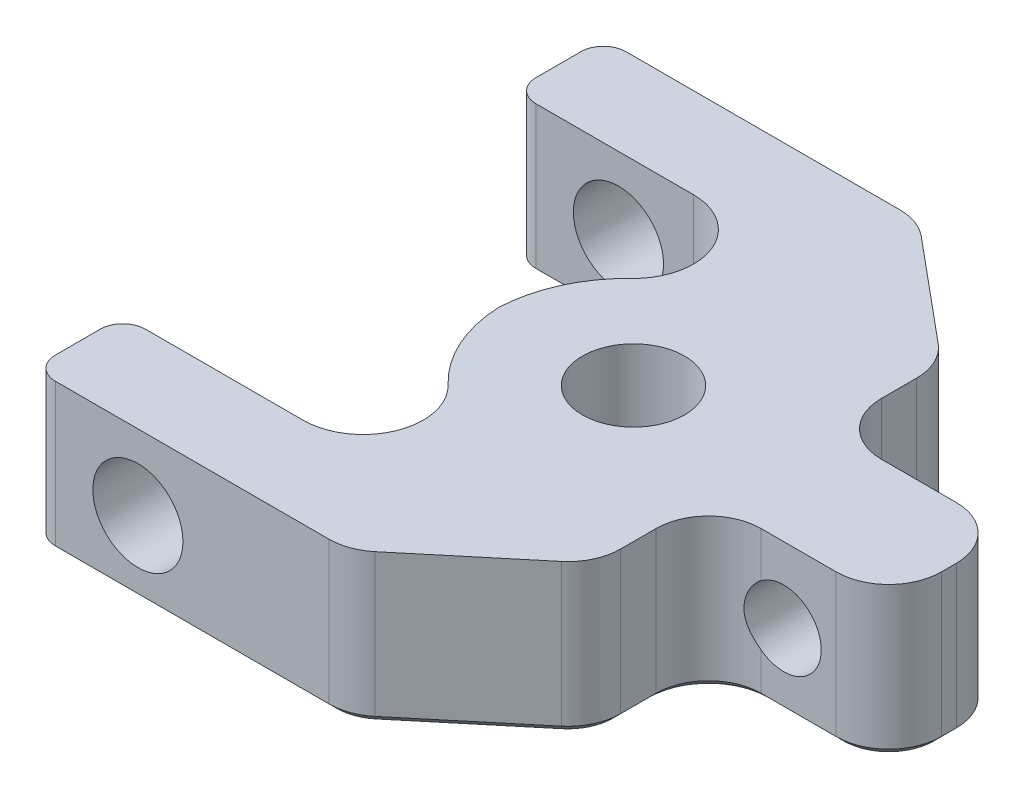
ISO-10303-21;
HEADER;
FILE_DESCRIPTION(('STEP AP214'),'2;1');
FILE_NAME('part.step','',(''),(''),'','','');
FILE_SCHEMA(('AUTOMOTIVE_DESIGN { 1 0 10303 214 1 1 1 1 }'));
ENDSEC;
DATA;
#1=APPLICATION_CONTEXT('core data for automotive mechanical design processes');
#2=APPLICATION_PROTOCOL_DEFINITION('international standard','automotive_design',2000,#1);
#3=PRODUCT_CONTEXT('',#1,'mechanical');
#4=PRODUCT('Part','Part','',(#3));
#5=PRODUCT_RELATED_PRODUCT_CATEGORY('part','',(#4));
#6=PRODUCT_DEFINITION_FORMATION('','',#4);
#7=PRODUCT_DEFINITION_CONTEXT('part definition',#1,'design');
#8=PRODUCT_DEFINITION('design','',#6,#7);
#9=PRODUCT_DEFINITION_SHAPE('','',#8);
#10=(LENGTH_UNIT() NAMED_UNIT(*) SI_UNIT(.MILLI.,.METRE.));
#11=(NAMED_UNIT(*) PLANE_ANGLE_UNIT() SI_UNIT($,.RADIAN.));
#12=(NAMED_UNIT(*) SI_UNIT($,.STERADIAN.) SOLID_ANGLE_UNIT());
#13=UNCERTAINTY_MEASURE_WITH_UNIT(LENGTH_MEASURE(1.E-05),#10,'distance_accuracy_value','');
#14=(GEOMETRIC_REPRESENTATION_CONTEXT(3) GLOBAL_UNCERTAINTY_ASSIGNED_CONTEXT((#13)) GLOBAL_UNIT_ASSIGNED_CONTEXT((#10,
#11,#12)) REPRESENTATION_CONTEXT('',''));
#15=CARTESIAN_POINT('',(0.,0.,0.));
#16=DIRECTION('',(0.,0.,1.));
#17=DIRECTION('',(1.,0.,0.));
#18=AXIS2_PLACEMENT_3D('',#15,#16,#17);
#19=CARTESIAN_POINT('',(21.,0.,19.));
#20=DIRECTION('',(0.,-1.,0.));
#21=DIRECTION('',(1.,0.,0.));
#22=AXIS2_PLACEMENT_3D('',#19,#20,#21);
#23=PLANE('',#22);
#24=CARTESIAN_POINT('',(0.,0.,0.380831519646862));
#25=DIRECTION('',(0.,-1.,0.));
#26=DIRECTION('',(1.,0.,0.));
#27=AXIS2_PLACEMENT_3D('',#24,#25,#26);
#28=CIRCLE('',#27,9.);
#29=CARTESIAN_POINT('',(-6.23076923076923,0.,-6.11359030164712));
#30=VERTEX_POINT('',#29);
#31=CARTESIAN_POINT('',(-8.99193902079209,0.,0.));
#32=VERTEX_POINT('',#31);
#33=EDGE_CURVE('E1001',#30,#32,#28,.F.);
#34=ORIENTED_EDGE('',*,*,#33,.T.);
#35=CARTESIAN_POINT('',(0.,0.,-0.380831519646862));
#36=DIRECTION('',(0.,-1.,0.));
#37=DIRECTION('',(1.,0.,0.));
#38=AXIS2_PLACEMENT_3D('',#35,#36,#37);
#39=CIRCLE('',#38,9.);
#40=CARTESIAN_POINT('',(-6.23076923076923,0.,6.11359030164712));
#41=VERTEX_POINT('',#40);
#42=EDGE_CURVE('E334',#32,#41,#39,.F.);
#43=ORIENTED_EDGE('',*,*,#42,.T.);
#44=CARTESIAN_POINT('',(-8.99999999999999,0.,9.));
#45=DIRECTION('',(0.,1.,0.));
#46=DIRECTION('',(-1.,0.,0.));
#47=AXIS2_PLACEMENT_3D('',#44,#45,#46);
#48=CIRCLE('',#47,4.);
#49=CARTESIAN_POINT('',(-8.99999999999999,0.,13.));
#50=VERTEX_POINT('',#49);
#51=EDGE_CURVE('E323',#50,#41,#48,.T.);
#52=ORIENTED_EDGE('',*,*,#51,.F.);
#53=DIRECTION('',(1.,0.,0.));
#54=VECTOR('',#53,1.);
#55=CARTESIAN_POINT('',(-21.,0.,13.));
#56=LINE('',#55,#54);
#57=CARTESIAN_POINT('',(-19.5,0.,13.));
#58=VERTEX_POINT('',#57);
#59=EDGE_CURVE('E332',#58,#50,#56,.T.);
#60=ORIENTED_EDGE('',*,*,#59,.F.);
#61=CARTESIAN_POINT('',(-19.5,0.,14.5));
#62=DIRECTION('',(0.,-1.,0.));
#63=DIRECTION('',(1.,0.,0.));
#64=AXIS2_PLACEMENT_3D('',#61,#62,#63);
#65=CIRCLE('',#64,1.5);
#66=CARTESIAN_POINT('',(-21.,0.,14.5));
#67=VERTEX_POINT('',#66);
#68=EDGE_CURVE('E1062',#58,#67,#65,.F.);
#69=ORIENTED_EDGE('',*,*,#68,.T.);
#70=DIRECTION('',(0.,0.,-1.));
#71=VECTOR('',#70,1.);
#72=CARTESIAN_POINT('',(-21.,0.,19.));
#73=LINE('',#72,#71);
#74=CARTESIAN_POINT('',(-21.,0.,17.5));
#75=VERTEX_POINT('',#74);
#76=EDGE_CURVE('E360',#75,#67,#73,.T.);
#77=ORIENTED_EDGE('',*,*,#76,.F.);
#78=CARTESIAN_POINT('',(-19.5,0.,17.5));
#79=DIRECTION('',(0.,-1.,0.));
#80=DIRECTION('',(1.,0.,0.));
#81=AXIS2_PLACEMENT_3D('',#78,#79,#80);
#82=CIRCLE('',#81,1.5);
#83=CARTESIAN_POINT('',(-19.5,0.,19.));
#84=VERTEX_POINT('',#83);
#85=EDGE_CURVE('E994',#75,#84,#82,.F.);
#86=ORIENTED_EDGE('',*,*,#85,.T.);
#87=DIRECTION('',(-1.,0.,0.));
#88=VECTOR('',#87,1.);
#89=CARTESIAN_POINT('',(21.,0.,19.));
#90=LINE('',#89,#88);
#91=CARTESIAN_POINT('',(-1.26717477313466,0.,19.));
#92=VERTEX_POINT('',#91);
#93=EDGE_CURVE('E352',#92,#84,#90,.T.);
#94=ORIENTED_EDGE('',*,*,#93,.F.);
#95=CARTESIAN_POINT('',(-1.26717477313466,0.,15.5));
#96=DIRECTION('',(0.,-1.,0.));
#97=DIRECTION('',(1.,0.,0.));
#98=AXIS2_PLACEMENT_3D('',#95,#96,#97);
#99=CIRCLE('',#98,3.5);
#100=CARTESIAN_POINT('',(0.973470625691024,0.,18.1887744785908));
#101=VERTEX_POINT('',#100);
#102=EDGE_CURVE('E394',#92,#101,#99,.F.);
#103=ORIENTED_EDGE('',*,*,#102,.T.);
#104=DIRECTION('',(-0.768221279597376,0.,0.64018439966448));
#105=VECTOR('',#104,1.);
#106=CARTESIAN_POINT('',(9.,0.,11.5));
#107=LINE('',#106,#105);
#108=CARTESIAN_POINT('',(7.74064539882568,0.,12.5494621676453));
#109=VERTEX_POINT('',#108);
#110=EDGE_CURVE('E896',#109,#101,#107,.T.);
#111=ORIENTED_EDGE('',*,*,#110,.F.);
#112=CARTESIAN_POINT('',(5.5,0.,9.86068768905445));
#113=DIRECTION('',(0.,-1.,0.));
#114=DIRECTION('',(1.,0.,0.));
#115=AXIS2_PLACEMENT_3D('',#112,#113,#114);
#116=CIRCLE('',#115,3.5);
#117=CARTESIAN_POINT('',(9.,0.,9.86068768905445));
#118=VERTEX_POINT('',#117);
#119=EDGE_CURVE('E392',#109,#118,#116,.F.);
#120=ORIENTED_EDGE('',*,*,#119,.T.);
#121=DIRECTION('',(0.,0.,1.));
#122=VECTOR('',#121,1.);
#123=CARTESIAN_POINT('',(9.,0.,11.5));
#124=LINE('',#123,#122);
#125=CARTESIAN_POINT('',(9.,0.,7.5));
#126=VERTEX_POINT('',#125);
#127=EDGE_CURVE('E901',#126,#118,#124,.T.);
#128=ORIENTED_EDGE('',*,*,#127,.F.);
#129=CARTESIAN_POINT('',(12.5,0.,7.5));
#130=DIRECTION('',(0.,-1.,0.));
#131=DIRECTION('',(1.,0.,0.));
#132=AXIS2_PLACEMENT_3D('',#129,#130,#131);
#133=CIRCLE('',#132,3.5);
#134=CARTESIAN_POINT('',(12.5,0.,4.));
#135=VERTEX_POINT('',#134);
#136=EDGE_CURVE('E428',#126,#135,#133,.T.);
#137=ORIENTED_EDGE('',*,*,#136,.T.);
#138=DIRECTION('',(-1.,0.,0.));
#139=VECTOR('',#138,1.);
#140=CARTESIAN_POINT('',(21.,0.,4.));
#141=LINE('',#140,#139);
#142=CARTESIAN_POINT('',(17.5,0.,4.));
#143=VERTEX_POINT('',#142);
#144=EDGE_CURVE('E732',#143,#135,#141,.T.);
#145=ORIENTED_EDGE('',*,*,#144,.F.);
#146=CARTESIAN_POINT('',(17.5,0.,0.499999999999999));
#147=DIRECTION('',(0.,-1.,0.));
#148=DIRECTION('',(1.,0.,0.));
#149=AXIS2_PLACEMENT_3D('',#146,#147,#148);
#150=CIRCLE('',#149,3.5);
#151=CARTESIAN_POINT('',(21.,0.,0.5));
#152=VERTEX_POINT('',#151);
#153=EDGE_CURVE('E388',#143,#152,#150,.F.);
#154=ORIENTED_EDGE('',*,*,#153,.T.);
#155=DIRECTION('',(0.,0.,-1.));
#156=VECTOR('',#155,1.);
#157=CARTESIAN_POINT('',(21.,0.,19.));
#158=LINE('',#157,#156);
#159=CARTESIAN_POINT('',(21.,0.,-0.500000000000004));
#160=VERTEX_POINT('',#159);
#161=EDGE_CURVE('E361',#152,#160,#158,.T.);
#162=ORIENTED_EDGE('',*,*,#161,.T.);
#163=CARTESIAN_POINT('',(17.5,0.,-0.500000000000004));
#164=DIRECTION('',(0.,-1.,0.));
#165=DIRECTION('',(1.,0.,0.));
#166=AXIS2_PLACEMENT_3D('',#163,#164,#165);
#167=CIRCLE('',#166,3.5);
#168=CARTESIAN_POINT('',(17.5,0.,-4.));
#169=VERTEX_POINT('',#168);
#170=EDGE_CURVE('E390',#160,#169,#167,.F.);
#171=ORIENTED_EDGE('',*,*,#170,.T.);
#172=DIRECTION('',(1.,0.,0.));
#173=VECTOR('',#172,1.);
#174=CARTESIAN_POINT('',(21.,0.,-4.));
#175=LINE('',#174,#173);
#176=CARTESIAN_POINT('',(12.5,0.,-4.));
#177=VERTEX_POINT('',#176);
#178=EDGE_CURVE('E341',#177,#169,#175,.T.);
#179=ORIENTED_EDGE('',*,*,#178,.F.);
#180=CARTESIAN_POINT('',(12.5,0.,-7.5));
#181=DIRECTION('',(0.,-1.,0.));
#182=DIRECTION('',(1.,0.,0.));
#183=AXIS2_PLACEMENT_3D('',#180,#181,#182);
#184=CIRCLE('',#183,3.5);
#185=CARTESIAN_POINT('',(9.,0.,-7.5));
#186=VERTEX_POINT('',#185);
#187=EDGE_CURVE('E426',#177,#186,#184,.T.);
#188=ORIENTED_EDGE('',*,*,#187,.T.);
#189=DIRECTION('',(0.,0.,1.));
#190=VECTOR('',#189,1.);
#191=CARTESIAN_POINT('',(9.,0.,-11.5));
#192=LINE('',#191,#190);
#193=CARTESIAN_POINT('',(9.,0.,-9.86068768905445));
#194=VERTEX_POINT('',#193);
#195=EDGE_CURVE('E346',#194,#186,#192,.T.);
#196=ORIENTED_EDGE('',*,*,#195,.F.);
#197=CARTESIAN_POINT('',(5.5,0.,-9.86068768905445));
#198=DIRECTION('',(0.,-1.,0.));
#199=DIRECTION('',(1.,0.,0.));
#200=AXIS2_PLACEMENT_3D('',#197,#198,#199);
#201=CIRCLE('',#200,3.5);
#202=CARTESIAN_POINT('',(7.74064539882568,0.,-12.5494621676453));
#203=VERTEX_POINT('',#202);
#204=EDGE_CURVE('E396',#194,#203,#201,.F.);
#205=ORIENTED_EDGE('',*,*,#204,.T.);
#206=DIRECTION('',(0.768221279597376,0.,0.64018439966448));
#207=VECTOR('',#206,1.);
#208=CARTESIAN_POINT('',(9.,0.,-11.5));
#209=LINE('',#208,#207);
#210=CARTESIAN_POINT('',(0.973470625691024,0.,-18.1887744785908));
#211=VERTEX_POINT('',#210);
#212=EDGE_CURVE('E895',#211,#203,#209,.T.);
#213=ORIENTED_EDGE('',*,*,#212,.F.);
#214=CARTESIAN_POINT('',(-1.26717477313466,0.,-15.5));
#215=DIRECTION('',(0.,-1.,0.));
#216=DIRECTION('',(1.,0.,0.));
#217=AXIS2_PLACEMENT_3D('',#214,#215,#216);
#218=CIRCLE('',#217,3.5);
#219=CARTESIAN_POINT('',(-1.26717477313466,0.,-19.));
#220=VERTEX_POINT('',#219);
#221=EDGE_CURVE('E398',#211,#220,#218,.F.);
#222=ORIENTED_EDGE('',*,*,#221,.T.);
#223=DIRECTION('',(-1.,0.,0.));
#224=VECTOR('',#223,1.);
#225=CARTESIAN_POINT('',(21.,0.,-19.));
#226=LINE('',#225,#224);
#227=CARTESIAN_POINT('',(-19.5,0.,-19.));
#228=VERTEX_POINT('',#227);
#229=EDGE_CURVE('E350',#220,#228,#226,.T.);
#230=ORIENTED_EDGE('',*,*,#229,.T.);
#231=CARTESIAN_POINT('',(-19.5,0.,-17.5));
#232=DIRECTION('',(0.,-1.,0.));
#233=DIRECTION('',(1.,0.,0.));
#234=AXIS2_PLACEMENT_3D('',#231,#232,#233);
#235=CIRCLE('',#234,1.5);
#236=CARTESIAN_POINT('',(-21.,0.,-17.5));
#237=VERTEX_POINT('',#236);
#238=EDGE_CURVE('E1063',#228,#237,#235,.F.);
#239=ORIENTED_EDGE('',*,*,#238,.T.);
#240=CARTESIAN_POINT('',(-21.,0.,-14.5));
#241=VERTEX_POINT('',#240);
#242=EDGE_CURVE('E355',#241,#237,#73,.T.);
#243=ORIENTED_EDGE('',*,*,#242,.F.);
#244=CARTESIAN_POINT('',(-19.5,0.,-14.5));
#245=DIRECTION('',(0.,-1.,0.));
#246=DIRECTION('',(1.,0.,0.));
#247=AXIS2_PLACEMENT_3D('',#244,#245,#246);
#248=CIRCLE('',#247,1.5);
#249=CARTESIAN_POINT('',(-19.5,0.,-13.));
#250=VERTEX_POINT('',#249);
#251=EDGE_CURVE('E1061',#241,#250,#248,.F.);
#252=ORIENTED_EDGE('',*,*,#251,.T.);
#253=DIRECTION('',(-1.,0.,0.));
#254=VECTOR('',#253,1.);
#255=CARTESIAN_POINT('',(-21.,0.,-13.));
#256=LINE('',#255,#254);
#257=CARTESIAN_POINT('',(-9.,0.,-13.));
#258=VERTEX_POINT('',#257);
#259=EDGE_CURVE('E327',#258,#250,#256,.T.);
#260=ORIENTED_EDGE('',*,*,#259,.F.);
#261=CARTESIAN_POINT('',(-8.99999999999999,0.,-9.));
#262=DIRECTION('',(0.,1.,0.));
#263=DIRECTION('',(-1.,0.,0.));
#264=AXIS2_PLACEMENT_3D('',#261,#262,#263);
#265=CIRCLE('',#264,4.);
#266=EDGE_CURVE('E335',#30,#258,#265,.T.);
#267=ORIENTED_EDGE('',*,*,#266,.F.);
#268=EDGE_LOOP('',(#34,#43,#52,#60,#69,#77,#86,#94,#103,#111,#120,#128,#137,#145,#154,#162,#171,
#179,#188,#196,#205,#213,#222,#230,#239,#243,#252,#260,#267));
#269=FACE_BOUND('',#268,.T.);
#270=CARTESIAN_POINT('',(0.,0.,0.));
#271=DIRECTION('',(0.,1.,0.));
#272=DIRECTION('',(0.,0.,1.));
#273=AXIS2_PLACEMENT_3D('',#270,#271,#272);
#274=CIRCLE('',#273,3.39999999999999);
#275=CARTESIAN_POINT('',(0.,0.,3.39999999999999));
#276=VERTEX_POINT('',#275);
#277=EDGE_CURVE('E372',#276,#276,#274,.T.);
#278=ORIENTED_EDGE('',*,*,#277,.F.);
#279=EDGE_LOOP('',(#278));
#280=FACE_BOUND('',#279,.T.);
#281=ADVANCED_FACE('F32',(#269,#280),#23,.F.);
#282=CARTESIAN_POINT('',(-21.,0.,19.));
#283=DIRECTION('',(1.,0.,0.));
#284=DIRECTION('',(0.,0.,-1.));
#285=AXIS2_PLACEMENT_3D('',#282,#283,#284);
#286=PLANE('',#285);
#287=DIRECTION('',(0.,-1.,0.));
#288=VECTOR('',#287,1.);
#289=CARTESIAN_POINT('',(-21.,0.,-17.5));
#290=LINE('',#289,#288);
#291=CARTESIAN_POINT('',(-21.,-9.5,-17.5));
#292=VERTEX_POINT('',#291);
#293=EDGE_CURVE('E986',#237,#292,#290,.T.);
#294=ORIENTED_EDGE('',*,*,#293,.T.);
#295=DIRECTION('',(0.,0.,1.));
#296=VECTOR('',#295,1.);
#297=CARTESIAN_POINT('',(-21.,-9.5,19.));
#298=LINE('',#297,#296);
#299=CARTESIAN_POINT('',(-21.,-9.5,-14.5));
#300=VERTEX_POINT('',#299);
#301=EDGE_CURVE('E850',#292,#300,#298,.T.);
#302=ORIENTED_EDGE('',*,*,#301,.T.);
#303=DIRECTION('',(0.,1.,0.));
#304=VECTOR('',#303,1.);
#305=CARTESIAN_POINT('',(-21.,0.,-14.5));
#306=LINE('',#305,#304);
#307=EDGE_CURVE('E990',#300,#241,#306,.T.);
#308=ORIENTED_EDGE('',*,*,#307,.T.);
#309=ORIENTED_EDGE('',*,*,#242,.T.);
#310=EDGE_LOOP('',(#294,#302,#308,#309));
#311=FACE_BOUND('',#310,.T.);
#312=ADVANCED_FACE('F499',(#311),#286,.F.);
#313=CARTESIAN_POINT('',(-21.,-10.,19.));
#314=DIRECTION('',(0.,1.,0.));
#315=DIRECTION('',(0.,0.,1.));
#316=AXIS2_PLACEMENT_3D('',#313,#314,#315);
#317=PLANE('',#316);
#318=CARTESIAN_POINT('',(0.,-10.,-0.380831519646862));
#319=DIRECTION('',(0.,1.,0.));
#320=DIRECTION('',(0.,0.,1.));
#321=AXIS2_PLACEMENT_3D('',#318,#319,#320);
#322=CIRCLE('',#321,8.49999999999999);
#323=CARTESIAN_POINT('',(-5.88461538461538,-10.,5.752789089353));
#324=VERTEX_POINT('',#323);
#325=CARTESIAN_POINT('',(-8.49146438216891,-10.,0.));
#326=VERTEX_POINT('',#325);
#327=EDGE_CURVE('E1015',#324,#326,#322,.F.);
#328=ORIENTED_EDGE('',*,*,#327,.T.);
#329=CARTESIAN_POINT('',(0.,-10.,0.380831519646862));
#330=DIRECTION('',(0.,1.,0.));
#331=DIRECTION('',(0.,0.,1.));
#332=AXIS2_PLACEMENT_3D('',#329,#330,#331);
#333=CIRCLE('',#332,8.49999999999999);
#334=CARTESIAN_POINT('',(-5.88461538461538,-10.,-5.752789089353));
#335=VERTEX_POINT('',#334);
#336=EDGE_CURVE('E836',#326,#335,#333,.F.);
#337=ORIENTED_EDGE('',*,*,#336,.T.);
#338=CARTESIAN_POINT('',(-8.99999999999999,-10.,-9.));
#339=DIRECTION('',(0.,1.,0.));
#340=DIRECTION('',(0.,0.,1.));
#341=AXIS2_PLACEMENT_3D('',#338,#339,#340);
#342=CIRCLE('',#341,4.50000000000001);
#343=CARTESIAN_POINT('',(-9.,-10.,-13.5));
#344=VERTEX_POINT('',#343);
#345=EDGE_CURVE('E825',#335,#344,#342,.T.);
#346=ORIENTED_EDGE('',*,*,#345,.T.);
#347=DIRECTION('',(-1.,0.,0.));
#348=VECTOR('',#347,1.);
#349=CARTESIAN_POINT('',(-21.,-10.,-13.5));
#350=LINE('',#349,#348);
#351=CARTESIAN_POINT('',(-19.5,-10.,-13.5));
#352=VERTEX_POINT('',#351);
#353=EDGE_CURVE('E831',#344,#352,#350,.T.);
#354=ORIENTED_EDGE('',*,*,#353,.T.);
#355=CARTESIAN_POINT('',(-19.5,-10.,-14.5));
#356=DIRECTION('',(0.,1.,0.));
#357=DIRECTION('',(0.,0.,1.));
#358=AXIS2_PLACEMENT_3D('',#355,#356,#357);
#359=CIRCLE('',#358,0.999999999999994);
#360=CARTESIAN_POINT('',(-20.5,-10.,-14.5));
#361=VERTEX_POINT('',#360);
#362=EDGE_CURVE('E834',#352,#361,#359,.F.);
#363=ORIENTED_EDGE('',*,*,#362,.T.);
#364=DIRECTION('',(0.,0.,-1.));
#365=VECTOR('',#364,1.);
#366=CARTESIAN_POINT('',(-20.5,-10.,19.));
#367=LINE('',#366,#365);
#368=CARTESIAN_POINT('',(-20.5,-10.,-17.5));
#369=VERTEX_POINT('',#368);
#370=EDGE_CURVE('E838',#361,#369,#367,.T.);
#371=ORIENTED_EDGE('',*,*,#370,.T.);
#372=CARTESIAN_POINT('',(-19.5,-10.,-17.5));
#373=DIRECTION('',(0.,1.,0.));
#374=DIRECTION('',(0.,0.,1.));
#375=AXIS2_PLACEMENT_3D('',#372,#373,#374);
#376=CIRCLE('',#375,0.999999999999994);
#377=CARTESIAN_POINT('',(-19.5,-10.,-18.5));
#378=VERTEX_POINT('',#377);
#379=EDGE_CURVE('E1049',#369,#378,#376,.F.);
#380=ORIENTED_EDGE('',*,*,#379,.T.);
#381=DIRECTION('',(1.,0.,0.));
#382=VECTOR('',#381,1.);
#383=CARTESIAN_POINT('',(-21.,-10.,-18.5));
#384=LINE('',#383,#382);
#385=CARTESIAN_POINT('',(-1.26717477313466,-10.,-18.5));
#386=VERTEX_POINT('',#385);
#387=EDGE_CURVE('E979',#378,#386,#384,.T.);
#388=ORIENTED_EDGE('',*,*,#387,.T.);
#389=CARTESIAN_POINT('',(-1.26717477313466,-10.,-15.5));
#390=DIRECTION('',(0.,1.,0.));
#391=DIRECTION('',(0.,0.,1.));
#392=AXIS2_PLACEMENT_3D('',#389,#390,#391);
#393=CIRCLE('',#392,2.99999999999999);
#394=CARTESIAN_POINT('',(0.653378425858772,-10.,-17.8046638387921));
#395=VERTEX_POINT('',#394);
#396=EDGE_CURVE('E975',#386,#395,#393,.F.);
#397=ORIENTED_EDGE('',*,*,#396,.T.);
#398=DIRECTION('',(0.768221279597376,0.,0.64018439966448));
#399=VECTOR('',#398,1.);
#400=CARTESIAN_POINT('',(5.97498976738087,-10.,-13.369987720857));
#401=LINE('',#400,#399);
#402=CARTESIAN_POINT('',(7.42055319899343,-10.,-12.1653515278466));
#403=VERTEX_POINT('',#402);
#404=EDGE_CURVE('E1045',#395,#403,#401,.T.);
#405=ORIENTED_EDGE('',*,*,#404,.T.);
#406=CARTESIAN_POINT('',(5.5,-10.,-9.86068768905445));
#407=DIRECTION('',(0.,1.,0.));
#408=DIRECTION('',(0.,0.,1.));
#409=AXIS2_PLACEMENT_3D('',#406,#407,#408);
#410=CIRCLE('',#409,2.99999999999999);
#411=CARTESIAN_POINT('',(8.49999999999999,-10.,-9.86068768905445));
#412=VERTEX_POINT('',#411);
#413=EDGE_CURVE('E1043',#403,#412,#410,.F.);
#414=ORIENTED_EDGE('',*,*,#413,.T.);
#415=DIRECTION('',(0.,0.,1.));
#416=VECTOR('',#415,1.);
#417=CARTESIAN_POINT('',(8.5,-10.,19.));
#418=LINE('',#417,#416);
#419=CARTESIAN_POINT('',(8.49999999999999,-10.,-7.5));
#420=VERTEX_POINT('',#419);
#421=EDGE_CURVE('E1041',#412,#420,#418,.T.);
#422=ORIENTED_EDGE('',*,*,#421,.T.);
#423=CARTESIAN_POINT('',(12.5,-10.,-7.5));
#424=DIRECTION('',(0.,1.,0.));
#425=DIRECTION('',(0.,0.,1.));
#426=AXIS2_PLACEMENT_3D('',#423,#424,#425);
#427=CIRCLE('',#426,4.00000000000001);
#428=CARTESIAN_POINT('',(12.5,-10.,-3.49999999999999));
#429=VERTEX_POINT('',#428);
#430=EDGE_CURVE('E881',#420,#429,#427,.T.);
#431=ORIENTED_EDGE('',*,*,#430,.T.);
#432=DIRECTION('',(1.,0.,0.));
#433=VECTOR('',#432,1.);
#434=CARTESIAN_POINT('',(-21.,-10.,-3.49999999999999));
#435=LINE('',#434,#433);
#436=CARTESIAN_POINT('',(17.5,-10.,-3.5));
#437=VERTEX_POINT('',#436);
#438=EDGE_CURVE('E877',#429,#437,#435,.T.);
#439=ORIENTED_EDGE('',*,*,#438,.T.);
#440=CARTESIAN_POINT('',(17.5,-10.,-0.500000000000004));
#441=DIRECTION('',(0.,1.,0.));
#442=DIRECTION('',(0.,0.,1.));
#443=AXIS2_PLACEMENT_3D('',#440,#441,#442);
#444=CIRCLE('',#443,2.99999999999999);
#445=CARTESIAN_POINT('',(20.5,-10.,-0.500000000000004));
#446=VERTEX_POINT('',#445);
#447=EDGE_CURVE('E1037',#437,#446,#444,.F.);
#448=ORIENTED_EDGE('',*,*,#447,.T.);
#449=DIRECTION('',(0.,0.,1.));
#450=VECTOR('',#449,1.);
#451=CARTESIAN_POINT('',(20.5,-10.,19.));
#452=LINE('',#451,#450);
#453=CARTESIAN_POINT('',(20.5,-10.,0.5));
#454=VERTEX_POINT('',#453);
#455=EDGE_CURVE('E1035',#446,#454,#452,.T.);
#456=ORIENTED_EDGE('',*,*,#455,.T.);
#457=CARTESIAN_POINT('',(17.5,-10.,0.499999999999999));
#458=DIRECTION('',(0.,1.,0.));
#459=DIRECTION('',(0.,0.,1.));
#460=AXIS2_PLACEMENT_3D('',#457,#458,#459);
#461=CIRCLE('',#460,2.99999999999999);
#462=CARTESIAN_POINT('',(17.5,-10.,3.49999999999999));
#463=VERTEX_POINT('',#462);
#464=EDGE_CURVE('E533',#454,#463,#461,.F.);
#465=ORIENTED_EDGE('',*,*,#464,.T.);
#466=DIRECTION('',(-1.,0.,0.));
#467=VECTOR('',#466,1.);
#468=CARTESIAN_POINT('',(-21.,-10.,3.5));
#469=LINE('',#468,#467);
#470=CARTESIAN_POINT('',(12.5,-10.,3.49999999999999));
#471=VERTEX_POINT('',#470);
#472=EDGE_CURVE('E1032',#463,#471,#469,.T.);
#473=ORIENTED_EDGE('',*,*,#472,.T.);
#474=CARTESIAN_POINT('',(12.5,-10.,7.5));
#475=DIRECTION('',(0.,1.,0.));
#476=DIRECTION('',(0.,0.,1.));
#477=AXIS2_PLACEMENT_3D('',#474,#475,#476);
#478=CIRCLE('',#477,4.00000000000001);
#479=CARTESIAN_POINT('',(8.49999999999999,-10.,7.5));
#480=VERTEX_POINT('',#479);
#481=EDGE_CURVE('E749',#471,#480,#478,.T.);
#482=ORIENTED_EDGE('',*,*,#481,.T.);
#483=DIRECTION('',(0.,0.,1.));
#484=VECTOR('',#483,1.);
#485=CARTESIAN_POINT('',(8.49999999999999,-10.,19.));
#486=LINE('',#485,#484);
#487=CARTESIAN_POINT('',(8.49999999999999,-10.,9.86068768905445));
#488=VERTEX_POINT('',#487);
#489=EDGE_CURVE('E1029',#480,#488,#486,.T.);
#490=ORIENTED_EDGE('',*,*,#489,.T.);
#491=CARTESIAN_POINT('',(5.5,-10.,9.86068768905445));
#492=DIRECTION('',(0.,1.,0.));
#493=DIRECTION('',(0.,0.,1.));
#494=AXIS2_PLACEMENT_3D('',#491,#492,#493);
#495=CIRCLE('',#494,2.99999999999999);
#496=CARTESIAN_POINT('',(7.42055319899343,-10.,12.1653515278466));
#497=VERTEX_POINT('',#496);
#498=EDGE_CURVE('E1027',#488,#497,#495,.F.);
#499=ORIENTED_EDGE('',*,*,#498,.T.);
#500=DIRECTION('',(-0.768221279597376,0.,0.64018439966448));
#501=VECTOR('',#500,1.);
#502=CARTESIAN_POINT('',(-12.7135348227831,-10.,28.9437582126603));
#503=LINE('',#502,#501);
#504=CARTESIAN_POINT('',(0.653378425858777,-10.,17.8046638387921));
#505=VERTEX_POINT('',#504);
#506=EDGE_CURVE('E1025',#497,#505,#503,.T.);
#507=ORIENTED_EDGE('',*,*,#506,.T.);
#508=CARTESIAN_POINT('',(-1.26717477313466,-10.,15.5));
#509=DIRECTION('',(0.,1.,0.));
#510=DIRECTION('',(0.,0.,1.));
#511=AXIS2_PLACEMENT_3D('',#508,#509,#510);
#512=CIRCLE('',#511,2.99999999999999);
#513=CARTESIAN_POINT('',(-1.26717477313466,-10.,18.5));
#514=VERTEX_POINT('',#513);
#515=EDGE_CURVE('E1023',#505,#514,#512,.F.);
#516=ORIENTED_EDGE('',*,*,#515,.T.);
#517=DIRECTION('',(-1.,0.,0.));
#518=VECTOR('',#517,1.);
#519=CARTESIAN_POINT('',(-19.5,-10.,18.5));
#520=LINE('',#519,#518);
#521=CARTESIAN_POINT('',(-19.5,-10.,18.5));
#522=VERTEX_POINT('',#521);
#523=EDGE_CURVE('E1021',#514,#522,#520,.T.);
#524=ORIENTED_EDGE('',*,*,#523,.T.);
#525=CARTESIAN_POINT('',(-19.5,-10.,17.5));
#526=DIRECTION('',(0.,1.,0.));
#527=DIRECTION('',(0.,0.,1.));
#528=AXIS2_PLACEMENT_3D('',#525,#526,#527);
#529=CIRCLE('',#528,0.999999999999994);
#530=CARTESIAN_POINT('',(-20.5,-10.,17.5));
#531=VERTEX_POINT('',#530);
#532=EDGE_CURVE('E1019',#522,#531,#529,.F.);
#533=ORIENTED_EDGE('',*,*,#532,.T.);
#534=DIRECTION('',(0.,0.,-1.));
#535=VECTOR('',#534,1.);
#536=CARTESIAN_POINT('',(-20.5,-10.,19.));
#537=LINE('',#536,#535);
#538=CARTESIAN_POINT('',(-20.5,-10.,14.5));
#539=VERTEX_POINT('',#538);
#540=EDGE_CURVE('E1017',#531,#539,#537,.T.);
#541=ORIENTED_EDGE('',*,*,#540,.T.);
#542=CARTESIAN_POINT('',(-19.5,-10.,14.5));
#543=DIRECTION('',(0.,1.,0.));
#544=DIRECTION('',(0.,0.,1.));
#545=AXIS2_PLACEMENT_3D('',#542,#543,#544);
#546=CIRCLE('',#545,0.999999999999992);
#547=CARTESIAN_POINT('',(-19.5,-10.,13.5));
#548=VERTEX_POINT('',#547);
#549=EDGE_CURVE('E1013',#539,#548,#546,.F.);
#550=ORIENTED_EDGE('',*,*,#549,.T.);
#551=DIRECTION('',(1.,0.,0.));
#552=VECTOR('',#551,1.);
#553=CARTESIAN_POINT('',(-21.,-10.,13.5));
#554=LINE('',#553,#552);
#555=CARTESIAN_POINT('',(-8.99999999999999,-10.,13.5));
#556=VERTEX_POINT('',#555);
#557=EDGE_CURVE('E1008',#548,#556,#554,.T.);
#558=ORIENTED_EDGE('',*,*,#557,.T.);
#559=CARTESIAN_POINT('',(-8.99999999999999,-10.,9.));
#560=DIRECTION('',(0.,1.,0.));
#561=DIRECTION('',(0.,0.,1.));
#562=AXIS2_PLACEMENT_3D('',#559,#560,#561);
#563=CIRCLE('',#562,4.50000000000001);
#564=EDGE_CURVE('E1011',#556,#324,#563,.T.);
#565=ORIENTED_EDGE('',*,*,#564,.T.);
#566=EDGE_LOOP('',(#328,#337,#346,#354,#363,#371,#380,#388,#397,#405,#414,#422,#431,#439,#448,
#456,#465,#473,#482,#490,#499,#507,#516,#524,#533,#541,#550,#558,#565));
#567=FACE_BOUND('',#566,.T.);
#568=CARTESIAN_POINT('',(0.,-10.,0.));
#569=DIRECTION('',(0.,1.,0.));
#570=DIRECTION('',(0.,0.,1.));
#571=AXIS2_PLACEMENT_3D('',#568,#569,#570);
#572=CIRCLE('',#571,3.39999999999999);
#573=CARTESIAN_POINT('',(0.,-10.,3.39999999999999));
#574=VERTEX_POINT('',#573);
#575=EDGE_CURVE('E369',#574,#574,#572,.T.);
#576=ORIENTED_EDGE('',*,*,#575,.T.);
#577=EDGE_LOOP('',(#576));
#578=FACE_BOUND('',#577,.T.);
#579=ADVANCED_FACE('F477',(#567,#578),#317,.F.);
#580=CARTESIAN_POINT('',(21.,-10.,19.));
#581=DIRECTION('',(-1.,0.,0.));
#582=DIRECTION('',(0.,0.,1.));
#583=AXIS2_PLACEMENT_3D('',#580,#581,#582);
#584=PLANE('',#583);
#585=DIRECTION('',(0.,1.,0.));
#586=VECTOR('',#585,1.);
#587=CARTESIAN_POINT('',(21.,-10.,0.5));
#588=LINE('',#587,#586);
#589=CARTESIAN_POINT('',(21.,-9.5,0.5));
#590=VERTEX_POINT('',#589);
#591=EDGE_CURVE('E421',#152,#590,#588,.F.);
#592=ORIENTED_EDGE('',*,*,#591,.T.);
#593=DIRECTION('',(0.,0.,-1.));
#594=VECTOR('',#593,1.);
#595=CARTESIAN_POINT('',(21.,-9.5,19.));
#596=LINE('',#595,#594);
#597=CARTESIAN_POINT('',(21.,-9.5,-0.500000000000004));
#598=VERTEX_POINT('',#597);
#599=EDGE_CURVE('E522',#590,#598,#596,.T.);
#600=ORIENTED_EDGE('',*,*,#599,.T.);
#601=DIRECTION('',(0.,1.,0.));
#602=VECTOR('',#601,1.);
#603=CARTESIAN_POINT('',(21.,-10.,-0.500000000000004));
#604=LINE('',#603,#602);
#605=EDGE_CURVE('E424',#598,#160,#604,.T.);
#606=ORIENTED_EDGE('',*,*,#605,.T.);
#607=ORIENTED_EDGE('',*,*,#161,.F.);
#608=EDGE_LOOP('',(#592,#600,#606,#607));
#609=FACE_BOUND('',#608,.T.);
#610=ADVANCED_FACE('F508',(#609),#584,.F.);
#611=DIRECTION('',(0.,1.,0.));
#612=VECTOR('',#611,1.);
#613=CARTESIAN_POINT('',(-21.,0.,14.5));
#614=LINE('',#613,#612);
#615=CARTESIAN_POINT('',(-21.,-9.5,14.5));
#616=VERTEX_POINT('',#615);
#617=EDGE_CURVE('E1081',#67,#616,#614,.F.);
#618=ORIENTED_EDGE('',*,*,#617,.T.);
#619=DIRECTION('',(0.,0.,1.));
#620=VECTOR('',#619,1.);
#621=CARTESIAN_POINT('',(-21.,-9.5,19.));
#622=LINE('',#621,#620);
#623=CARTESIAN_POINT('',(-21.,-9.5,17.5));
#624=VERTEX_POINT('',#623);
#625=EDGE_CURVE('E565',#616,#624,#622,.T.);
#626=ORIENTED_EDGE('',*,*,#625,.T.);
#627=DIRECTION('',(0.,-1.,0.));
#628=VECTOR('',#627,1.);
#629=CARTESIAN_POINT('',(-21.,0.,17.5));
#630=LINE('',#629,#628);
#631=EDGE_CURVE('E1066',#624,#75,#630,.F.);
#632=ORIENTED_EDGE('',*,*,#631,.T.);
#633=ORIENTED_EDGE('',*,*,#76,.T.);
#634=EDGE_LOOP('',(#618,#626,#632,#633));
#635=FACE_BOUND('',#634,.T.);
#636=ADVANCED_FACE('F506',(#635),#286,.F.);
#637=CARTESIAN_POINT('',(21.,-10.,19.));
#638=DIRECTION('',(0.,0.,1.));
#639=DIRECTION('',(1.,0.,0.));
#640=AXIS2_PLACEMENT_3D('',#637,#638,#639);
#641=PLANE('',#640);
#642=CARTESIAN_POINT('',(-14.,-5.,19.));
#643=DIRECTION('',(0.,0.,1.));
#644=DIRECTION('',(1.,0.,0.));
#645=AXIS2_PLACEMENT_3D('',#642,#643,#644);
#646=CIRCLE('',#645,3.);
#647=CARTESIAN_POINT('',(-11.,-5.,19.));
#648=VERTEX_POINT('',#647);
#649=EDGE_CURVE('E905',#648,#648,#646,.T.);
#650=ORIENTED_EDGE('',*,*,#649,.F.);
#651=EDGE_LOOP('',(#650));
#652=FACE_BOUND('',#651,.T.);
#653=DIRECTION('',(0.,-1.,0.));
#654=VECTOR('',#653,1.);
#655=CARTESIAN_POINT('',(-19.5,-10.,19.));
#656=LINE('',#655,#654);
#657=CARTESIAN_POINT('',(-19.5,-9.5,19.));
#658=VERTEX_POINT('',#657);
#659=EDGE_CURVE('E438',#84,#658,#656,.T.);
#660=ORIENTED_EDGE('',*,*,#659,.T.);
#661=DIRECTION('',(1.,0.,0.));
#662=VECTOR('',#661,1.);
#663=CARTESIAN_POINT('',(-1.26717477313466,-9.5,19.));
#664=LINE('',#663,#662);
#665=CARTESIAN_POINT('',(-1.26717477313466,-9.5,19.));
#666=VERTEX_POINT('',#665);
#667=EDGE_CURVE('E561',#658,#666,#664,.T.);
#668=ORIENTED_EDGE('',*,*,#667,.T.);
#669=DIRECTION('',(0.,1.,0.));
#670=VECTOR('',#669,1.);
#671=CARTESIAN_POINT('',(-1.26717477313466,0.,19.));
#672=LINE('',#671,#670);
#673=EDGE_CURVE('E403',#666,#92,#672,.T.);
#674=ORIENTED_EDGE('',*,*,#673,.T.);
#675=ORIENTED_EDGE('',*,*,#93,.T.);
#676=EDGE_LOOP('',(#660,#668,#674,#675));
#677=FACE_BOUND('',#676,.T.);
#678=ADVANCED_FACE('F515',(#652,#677),#641,.T.);
#679=CARTESIAN_POINT('',(21.,-10.,-19.));
#680=DIRECTION('',(0.,0.,1.));
#681=DIRECTION('',(1.,0.,0.));
#682=AXIS2_PLACEMENT_3D('',#679,#680,#681);
#683=PLANE('',#682);
#684=CARTESIAN_POINT('',(-14.,-5.,-19.));
#685=DIRECTION('',(0.,0.,1.));
#686=DIRECTION('',(1.,0.,0.));
#687=AXIS2_PLACEMENT_3D('',#684,#685,#686);
#688=CIRCLE('',#687,3.);
#689=CARTESIAN_POINT('',(-11.,-5.,-19.));
#690=VERTEX_POINT('',#689);
#691=EDGE_CURVE('E908',#690,#690,#688,.T.);
#692=ORIENTED_EDGE('',*,*,#691,.T.);
#693=EDGE_LOOP('',(#692));
#694=FACE_BOUND('',#693,.T.);
#695=DIRECTION('',(0.,1.,0.));
#696=VECTOR('',#695,1.);
#697=CARTESIAN_POINT('',(-1.26717477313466,-10.,-19.));
#698=LINE('',#697,#696);
#699=CARTESIAN_POINT('',(-1.26717477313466,-9.5,-19.));
#700=VERTEX_POINT('',#699);
#701=EDGE_CURVE('E400',#220,#700,#698,.F.);
#702=ORIENTED_EDGE('',*,*,#701,.T.);
#703=DIRECTION('',(-1.,0.,0.));
#704=VECTOR('',#703,1.);
#705=CARTESIAN_POINT('',(21.,-9.5,-19.));
#706=LINE('',#705,#704);
#707=CARTESIAN_POINT('',(-19.5,-9.5,-19.));
#708=VERTEX_POINT('',#707);
#709=EDGE_CURVE('E854',#700,#708,#706,.T.);
#710=ORIENTED_EDGE('',*,*,#709,.T.);
#711=DIRECTION('',(0.,-1.,0.));
#712=VECTOR('',#711,1.);
#713=CARTESIAN_POINT('',(-19.5,-10.,-19.));
#714=LINE('',#713,#712);
#715=EDGE_CURVE('E987',#708,#228,#714,.F.);
#716=ORIENTED_EDGE('',*,*,#715,.T.);
#717=ORIENTED_EDGE('',*,*,#229,.F.);
#718=EDGE_LOOP('',(#702,#710,#716,#717));
#719=FACE_BOUND('',#718,.T.);
#720=ADVANCED_FACE('F954',(#694,#719),#683,.F.);
#721=CARTESIAN_POINT('',(-21.,-10.,-13.));
#722=DIRECTION('',(0.,0.,-1.));
#723=DIRECTION('',(-1.,0.,0.));
#724=AXIS2_PLACEMENT_3D('',#721,#722,#723);
#725=PLANE('',#724);
#726=CARTESIAN_POINT('',(-14.,-5.,-13.));
#727=DIRECTION('',(0.,0.,-1.));
#728=DIRECTION('',(-1.,0.,0.));
#729=AXIS2_PLACEMENT_3D('',#726,#727,#728);
#730=CIRCLE('',#729,3.);
#731=CARTESIAN_POINT('',(-17.,-5.,-13.));
#732=VERTEX_POINT('',#731);
#733=EDGE_CURVE('E368',#732,#732,#730,.T.);
#734=ORIENTED_EDGE('',*,*,#733,.T.);
#735=EDGE_LOOP('',(#734));
#736=FACE_BOUND('',#735,.T.);
#737=DIRECTION('',(0.,1.,0.));
#738=VECTOR('',#737,1.);
#739=CARTESIAN_POINT('',(-19.5,-10.,-13.));
#740=LINE('',#739,#738);
#741=CARTESIAN_POINT('',(-19.5,-9.5,-13.));
#742=VERTEX_POINT('',#741);
#743=EDGE_CURVE('E992',#250,#742,#740,.F.);
#744=ORIENTED_EDGE('',*,*,#743,.T.);
#745=DIRECTION('',(1.,0.,0.));
#746=VECTOR('',#745,1.);
#747=CARTESIAN_POINT('',(-21.,-9.5,-13.));
#748=LINE('',#747,#746);
#749=CARTESIAN_POINT('',(-9.,-9.5,-13.));
#750=VERTEX_POINT('',#749);
#751=EDGE_CURVE('E830',#742,#750,#748,.T.);
#752=ORIENTED_EDGE('',*,*,#751,.T.);
#753=DIRECTION('',(0.,1.,0.));
#754=VECTOR('',#753,1.);
#755=CARTESIAN_POINT('',(-9.,-10.,-13.));
#756=LINE('',#755,#754);
#757=EDGE_CURVE('E326',#750,#258,#756,.T.);
#758=ORIENTED_EDGE('',*,*,#757,.T.);
#759=ORIENTED_EDGE('',*,*,#259,.T.);
#760=EDGE_LOOP('',(#744,#752,#758,#759));
#761=FACE_BOUND('',#760,.T.);
#762=ADVANCED_FACE('F951',(#736,#761),#725,.F.);
#763=CARTESIAN_POINT('',(-21.,-10.,13.));
#764=DIRECTION('',(0.,0.,1.));
#765=DIRECTION('',(1.,0.,0.));
#766=AXIS2_PLACEMENT_3D('',#763,#764,#765);
#767=PLANE('',#766);
#768=CARTESIAN_POINT('',(-14.,-5.,13.));
#769=DIRECTION('',(0.,0.,1.));
#770=DIRECTION('',(1.,0.,0.));
#771=AXIS2_PLACEMENT_3D('',#768,#769,#770);
#772=CIRCLE('',#771,3.);
#773=CARTESIAN_POINT('',(-11.,-5.,13.));
#774=VERTEX_POINT('',#773);
#775=EDGE_CURVE('E365',#774,#774,#772,.T.);
#776=ORIENTED_EDGE('',*,*,#775,.T.);
#777=EDGE_LOOP('',(#776));
#778=FACE_BOUND('',#777,.T.);
#779=DIRECTION('',(0.,1.,0.));
#780=VECTOR('',#779,1.);
#781=CARTESIAN_POINT('',(-8.99999999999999,-10.,13.));
#782=LINE('',#781,#780);
#783=CARTESIAN_POINT('',(-8.99999999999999,-9.5,13.));
#784=VERTEX_POINT('',#783);
#785=EDGE_CURVE('E320',#784,#50,#782,.T.);
#786=ORIENTED_EDGE('',*,*,#785,.F.);
#787=DIRECTION('',(-1.,0.,0.));
#788=VECTOR('',#787,1.);
#789=CARTESIAN_POINT('',(-21.,-9.5,13.));
#790=LINE('',#789,#788);
#791=CARTESIAN_POINT('',(-19.5,-9.5,13.));
#792=VERTEX_POINT('',#791);
#793=EDGE_CURVE('E11',#784,#792,#790,.T.);
#794=ORIENTED_EDGE('',*,*,#793,.T.);
#795=DIRECTION('',(0.,1.,0.));
#796=VECTOR('',#795,1.);
#797=CARTESIAN_POINT('',(-19.5,-10.,13.));
#798=LINE('',#797,#796);
#799=EDGE_CURVE('E339',#792,#58,#798,.T.);
#800=ORIENTED_EDGE('',*,*,#799,.T.);
#801=ORIENTED_EDGE('',*,*,#59,.T.);
#802=EDGE_LOOP('',(#786,#794,#800,#801));
#803=FACE_BOUND('',#802,.T.);
#804=ADVANCED_FACE('F338',(#778,#803),#767,.F.);
#805=CARTESIAN_POINT('',(21.,-10.,-4.));
#806=DIRECTION('',(0.,0.,1.));
#807=DIRECTION('',(1.,0.,0.));
#808=AXIS2_PLACEMENT_3D('',#805,#806,#807);
#809=PLANE('',#808);
#810=DIRECTION('',(0.,1.,0.));
#811=VECTOR('',#810,1.);
#812=CARTESIAN_POINT('',(17.5,-10.,-4.));
#813=LINE('',#812,#811);
#814=CARTESIAN_POINT('',(17.5,-9.5,-4.));
#815=VERTEX_POINT('',#814);
#816=EDGE_CURVE('E364',#169,#815,#813,.F.);
#817=ORIENTED_EDGE('',*,*,#816,.T.);
#818=DIRECTION('',(-1.,0.,0.));
#819=VECTOR('',#818,1.);
#820=CARTESIAN_POINT('',(21.,-9.5,-4.));
#821=LINE('',#820,#819);
#822=CARTESIAN_POINT('',(12.5,-9.5,-4.));
#823=VERTEX_POINT('',#822);
#824=EDGE_CURVE('E546',#815,#823,#821,.T.);
#825=ORIENTED_EDGE('',*,*,#824,.T.);
#826=DIRECTION('',(0.,1.,0.));
#827=VECTOR('',#826,1.);
#828=CARTESIAN_POINT('',(12.5,0.,-4.));
#829=LINE('',#828,#827);
#830=CARTESIAN_POINT('',(12.5,-7.,-4.));
#831=VERTEX_POINT('',#830);
#832=EDGE_CURVE('E376',#823,#831,#829,.T.);
#833=ORIENTED_EDGE('',*,*,#832,.T.);
#834=CARTESIAN_POINT('',(14.,-5.,-4.));
#835=DIRECTION('',(0.,0.,1.));
#836=DIRECTION('',(1.,0.,0.));
#837=AXIS2_PLACEMENT_3D('',#834,#835,#836);
#838=CIRCLE('',#837,2.5);
#839=CARTESIAN_POINT('',(12.5,-3.00000000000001,-4.));
#840=VERTEX_POINT('',#839);
#841=EDGE_CURVE('E466',#831,#840,#838,.T.);
#842=ORIENTED_EDGE('',*,*,#841,.T.);
#843=EDGE_CURVE('E375',#840,#177,#829,.T.);
#844=ORIENTED_EDGE('',*,*,#843,.T.);
#845=ORIENTED_EDGE('',*,*,#178,.T.);
#846=EDGE_LOOP('',(#817,#825,#833,#842,#844,#845));
#847=FACE_BOUND('',#846,.T.);
#848=ADVANCED_FACE('F868',(#847),#809,.F.);
#849=CARTESIAN_POINT('',(9.,-10.,-11.5));
#850=DIRECTION('',(-1.,0.,0.));
#851=DIRECTION('',(0.,0.,1.));
#852=AXIS2_PLACEMENT_3D('',#849,#850,#851);
#853=PLANE('',#852);
#854=DIRECTION('',(0.,1.,0.));
#855=VECTOR('',#854,1.);
#856=CARTESIAN_POINT('',(9.,-10.,-7.5));
#857=LINE('',#856,#855);
#858=CARTESIAN_POINT('',(9.,-9.5,-7.5));
#859=VERTEX_POINT('',#858);
#860=EDGE_CURVE('E380',#186,#859,#857,.F.);
#861=ORIENTED_EDGE('',*,*,#860,.T.);
#862=DIRECTION('',(0.,0.,-1.));
#863=VECTOR('',#862,1.);
#864=CARTESIAN_POINT('',(9.,-9.5,-11.5));
#865=LINE('',#864,#863);
#866=CARTESIAN_POINT('',(9.,-9.5,-9.86068768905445));
#867=VERTEX_POINT('',#866);
#868=EDGE_CURVE('E862',#859,#867,#865,.T.);
#869=ORIENTED_EDGE('',*,*,#868,.T.);
#870=DIRECTION('',(0.,1.,0.));
#871=VECTOR('',#870,1.);
#872=CARTESIAN_POINT('',(9.,-10.,-9.86068768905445));
#873=LINE('',#872,#871);
#874=EDGE_CURVE('E378',#867,#194,#873,.T.);
#875=ORIENTED_EDGE('',*,*,#874,.T.);
#876=ORIENTED_EDGE('',*,*,#195,.T.);
#877=EDGE_LOOP('',(#861,#869,#875,#876));
#878=FACE_BOUND('',#877,.T.);
#879=ADVANCED_FACE('F887',(#878),#853,.F.);
#880=CARTESIAN_POINT('',(9.,-10.,-11.5));
#881=DIRECTION('',(-0.64018439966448,0.,0.768221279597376));
#882=DIRECTION('',(0.768221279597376,0.,0.64018439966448));
#883=AXIS2_PLACEMENT_3D('',#880,#881,#882);
#884=PLANE('',#883);
#885=DIRECTION('',(0.,1.,0.));
#886=VECTOR('',#885,1.);
#887=CARTESIAN_POINT('',(7.74064539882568,-10.,-12.5494621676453));
#888=LINE('',#887,#886);
#889=CARTESIAN_POINT('',(7.74064539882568,-9.5,-12.5494621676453));
#890=VERTEX_POINT('',#889);
#891=EDGE_CURVE('E383',#203,#890,#888,.F.);
#892=ORIENTED_EDGE('',*,*,#891,.T.);
#893=DIRECTION('',(-0.768221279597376,0.,-0.64018439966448));
#894=VECTOR('',#893,1.);
#895=CARTESIAN_POINT('',(9.,-9.5,-11.5));
#896=LINE('',#895,#894);
#897=CARTESIAN_POINT('',(0.97347062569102,-9.5,-18.1887744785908));
#898=VERTEX_POINT('',#897);
#899=EDGE_CURVE('E858',#890,#898,#896,.T.);
#900=ORIENTED_EDGE('',*,*,#899,.T.);
#901=DIRECTION('',(0.,1.,0.));
#902=VECTOR('',#901,1.);
#903=CARTESIAN_POINT('',(0.97347062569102,-10.,-18.1887744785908));
#904=LINE('',#903,#902);
#905=EDGE_CURVE('E386',#898,#211,#904,.T.);
#906=ORIENTED_EDGE('',*,*,#905,.T.);
#907=ORIENTED_EDGE('',*,*,#212,.T.);
#908=EDGE_LOOP('',(#892,#900,#906,#907));
#909=FACE_BOUND('',#908,.T.);
#910=ADVANCED_FACE('F937',(#909),#884,.F.);
#911=CARTESIAN_POINT('',(9.,-10.,11.5));
#912=DIRECTION('',(-0.64018439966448,0.,-0.768221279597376));
#913=DIRECTION('',(-0.768221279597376,0.,0.64018439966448));
#914=AXIS2_PLACEMENT_3D('',#911,#912,#913);
#915=PLANE('',#914);
#916=DIRECTION('',(0.,1.,0.));
#917=VECTOR('',#916,1.);
#918=CARTESIAN_POINT('',(0.973470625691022,-10.,18.1887744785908));
#919=LINE('',#918,#917);
#920=CARTESIAN_POINT('',(0.973470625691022,-9.5,18.1887744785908));
#921=VERTEX_POINT('',#920);
#922=EDGE_CURVE('E407',#101,#921,#919,.F.);
#923=ORIENTED_EDGE('',*,*,#922,.T.);
#924=DIRECTION('',(0.768221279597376,0.,-0.64018439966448));
#925=VECTOR('',#924,1.);
#926=CARTESIAN_POINT('',(9.,-9.5,11.5));
#927=LINE('',#926,#925);
#928=CARTESIAN_POINT('',(7.74064539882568,-9.5,12.5494621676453));
#929=VERTEX_POINT('',#928);
#930=EDGE_CURVE('E557',#921,#929,#927,.T.);
#931=ORIENTED_EDGE('',*,*,#930,.T.);
#932=DIRECTION('',(0.,1.,0.));
#933=VECTOR('',#932,1.);
#934=CARTESIAN_POINT('',(7.74064539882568,-10.,12.5494621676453));
#935=LINE('',#934,#933);
#936=EDGE_CURVE('E405',#929,#109,#935,.T.);
#937=ORIENTED_EDGE('',*,*,#936,.T.);
#938=ORIENTED_EDGE('',*,*,#110,.T.);
#939=EDGE_LOOP('',(#923,#931,#937,#938));
#940=FACE_BOUND('',#939,.T.);
#941=ADVANCED_FACE('F933',(#940),#915,.F.);
#942=CARTESIAN_POINT('',(9.,-10.,11.5));
#943=DIRECTION('',(-1.,0.,0.));
#944=DIRECTION('',(0.,-1.,0.));
#945=AXIS2_PLACEMENT_3D('',#942,#943,#944);
#946=PLANE('',#945);
#947=DIRECTION('',(0.,1.,0.));
#948=VECTOR('',#947,1.);
#949=CARTESIAN_POINT('',(9.,-10.,9.86068768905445));
#950=LINE('',#949,#948);
#951=CARTESIAN_POINT('',(9.,-9.5,9.86068768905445));
#952=VERTEX_POINT('',#951);
#953=EDGE_CURVE('E412',#118,#952,#950,.F.);
#954=ORIENTED_EDGE('',*,*,#953,.T.);
#955=DIRECTION('',(0.,0.,-1.));
#956=VECTOR('',#955,1.);
#957=CARTESIAN_POINT('',(9.,-9.5,11.5));
#958=LINE('',#957,#956);
#959=CARTESIAN_POINT('',(9.,-9.5,7.5));
#960=VERTEX_POINT('',#959);
#961=EDGE_CURVE('E553',#952,#960,#958,.T.);
#962=ORIENTED_EDGE('',*,*,#961,.T.);
#963=DIRECTION('',(0.,1.,0.));
#964=VECTOR('',#963,1.);
#965=CARTESIAN_POINT('',(9.,0.,7.5));
#966=LINE('',#965,#964);
#967=EDGE_CURVE('E410',#960,#126,#966,.T.);
#968=ORIENTED_EDGE('',*,*,#967,.T.);
#969=ORIENTED_EDGE('',*,*,#127,.T.);
#970=EDGE_LOOP('',(#954,#962,#968,#969));
#971=FACE_BOUND('',#970,.T.);
#972=ADVANCED_FACE('F936',(#971),#946,.F.);
#973=CARTESIAN_POINT('',(21.,-10.,4.));
#974=DIRECTION('',(0.,0.,-1.));
#975=DIRECTION('',(-1.,0.,0.));
#976=AXIS2_PLACEMENT_3D('',#973,#974,#975);
#977=PLANE('',#976);
#978=DIRECTION('',(0.,1.,0.));
#979=VECTOR('',#978,1.);
#980=CARTESIAN_POINT('',(12.5,-10.,4.));
#981=LINE('',#980,#979);
#982=CARTESIAN_POINT('',(12.5,-6.99999999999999,4.));
#983=VERTEX_POINT('',#982);
#984=CARTESIAN_POINT('',(12.5,-9.5,4.));
#985=VERTEX_POINT('',#984);
#986=EDGE_CURVE('E417',#983,#985,#981,.F.);
#987=ORIENTED_EDGE('',*,*,#986,.T.);
#988=DIRECTION('',(1.,0.,0.));
#989=VECTOR('',#988,1.);
#990=CARTESIAN_POINT('',(21.,-9.5,4.));
#991=LINE('',#990,#989);
#992=CARTESIAN_POINT('',(17.5,-9.5,4.));
#993=VERTEX_POINT('',#992);
#994=EDGE_CURVE('E544',#985,#993,#991,.T.);
#995=ORIENTED_EDGE('',*,*,#994,.T.);
#996=DIRECTION('',(0.,1.,0.));
#997=VECTOR('',#996,1.);
#998=CARTESIAN_POINT('',(17.5,-10.,4.));
#999=LINE('',#998,#997);
#1000=EDGE_CURVE('E415',#993,#143,#999,.T.);
#1001=ORIENTED_EDGE('',*,*,#1000,.T.);
#1002=ORIENTED_EDGE('',*,*,#144,.T.);
#1003=CARTESIAN_POINT('',(12.5,-3.00000000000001,4.));
#1004=VERTEX_POINT('',#1003);
#1005=EDGE_CURVE('E418',#135,#1004,#981,.F.);
#1006=ORIENTED_EDGE('',*,*,#1005,.T.);
#1007=CARTESIAN_POINT('',(14.,-5.,4.));
#1008=DIRECTION('',(0.,0.,-1.));
#1009=DIRECTION('',(-1.,0.,0.));
#1010=AXIS2_PLACEMENT_3D('',#1007,#1008,#1009);
#1011=CIRCLE('',#1010,2.5);
#1012=EDGE_CURVE('E467',#1004,#983,#1011,.T.);
#1013=ORIENTED_EDGE('',*,*,#1012,.T.);
#1014=EDGE_LOOP('',(#987,#995,#1001,#1002,#1006,#1013));
#1015=FACE_BOUND('',#1014,.T.);
#1016=ADVANCED_FACE('F736',(#1015),#977,.F.);
#1017=CARTESIAN_POINT('',(-14.,-5.,-22.));
#1018=DIRECTION('',(0.,0.,1.));
#1019=DIRECTION('',(1.,0.,0.));
#1020=AXIS2_PLACEMENT_3D('',#1017,#1018,#1019);
#1021=CYLINDRICAL_SURFACE('',#1020,3.);
#1022=ORIENTED_EDGE('',*,*,#649,.T.);
#1023=EDGE_LOOP('',(#1022));
#1024=FACE_BOUND('',#1023,.T.);
#1025=ORIENTED_EDGE('',*,*,#775,.F.);
#1026=EDGE_LOOP('',(#1025));
#1027=FACE_BOUND('',#1026,.T.);
#1028=ADVANCED_FACE('F924',(#1024,#1027),#1021,.F.);
#1029=ORIENTED_EDGE('',*,*,#733,.F.);
#1030=EDGE_LOOP('',(#1029));
#1031=FACE_BOUND('',#1030,.T.);
#1032=ORIENTED_EDGE('',*,*,#691,.F.);
#1033=EDGE_LOOP('',(#1032));
#1034=FACE_BOUND('',#1033,.T.);
#1035=ADVANCED_FACE('F918',(#1031,#1034),#1021,.F.);
#1036=CARTESIAN_POINT('',(0.,0.,0.));
#1037=DIRECTION('',(0.,1.,0.));
#1038=DIRECTION('',(0.,0.,1.));
#1039=AXIS2_PLACEMENT_3D('',#1036,#1037,#1038);
#1040=CYLINDRICAL_SURFACE('',#1039,3.39999999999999);
#1041=ORIENTED_EDGE('',*,*,#277,.T.);
#1042=EDGE_LOOP('',(#1041));
#1043=FACE_BOUND('',#1042,.T.);
#1044=ORIENTED_EDGE('',*,*,#575,.F.);
#1045=EDGE_LOOP('',(#1044));
#1046=FACE_BOUND('',#1045,.T.);
#1047=ADVANCED_FACE('F454',(#1043,#1046),#1040,.F.);
#1048=CARTESIAN_POINT('',(12.5,-10.,-7.5));
#1049=DIRECTION('',(0.,-1.,0.));
#1050=DIRECTION('',(1.,0.,0.));
#1051=AXIS2_PLACEMENT_3D('',#1048,#1049,#1050);
#1052=CYLINDRICAL_SURFACE('',#1051,3.5);
#1053=ORIENTED_EDGE('',*,*,#832,.F.);
#1054=CARTESIAN_POINT('',(12.5,-9.5,-7.5));
#1055=DIRECTION('',(0.,1.,0.));
#1056=DIRECTION('',(0.,0.,1.));
#1057=AXIS2_PLACEMENT_3D('',#1054,#1055,#1056);
#1058=CIRCLE('',#1057,3.5);
#1059=EDGE_CURVE('E864',#823,#859,#1058,.F.);
#1060=ORIENTED_EDGE('',*,*,#1059,.T.);
#1061=ORIENTED_EDGE('',*,*,#860,.F.);
#1062=ORIENTED_EDGE('',*,*,#187,.F.);
#1063=ORIENTED_EDGE('',*,*,#843,.F.);
#1064=CARTESIAN_POINT('',(12.5,-3.00000000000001,-4.));
#1065=CARTESIAN_POINT('',(12.4444920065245,-3.04162804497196,-3.99999817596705));
#1066=CARTESIAN_POINT('',(12.3907612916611,-3.0855411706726,-4.00132055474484));
#1067=CARTESIAN_POINT('',(12.2872093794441,-3.17759903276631,-4.00609071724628));
#1068=CARTESIAN_POINT('',(12.2373859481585,-3.22574131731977,-4.00953727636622));
#1069=CARTESIAN_POINT('',(12.0944333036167,-3.37585188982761,-4.02226295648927));
#1070=CARTESIAN_POINT('',(12.0075654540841,-3.48369681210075,-4.03393285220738));
#1071=CARTESIAN_POINT('',(11.8530228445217,-3.7117941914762,-4.05942245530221));
#1072=CARTESIAN_POINT('',(11.7853219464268,-3.83202944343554,-4.07323919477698));
#1073=CARTESIAN_POINT('',(11.6705104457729,-4.08217556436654,-4.09920294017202));
#1074=CARTESIAN_POINT('',(11.6234015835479,-4.21208725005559,-4.11134980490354));
#1075=CARTESIAN_POINT('',(11.5503373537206,-4.481308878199,-4.13107870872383));
#1076=CARTESIAN_POINT('',(11.5248890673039,-4.62076561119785,-4.13855029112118));
#1077=CARTESIAN_POINT('',(11.4979239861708,-4.90214937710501,-4.14648643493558));
#1078=CARTESIAN_POINT('',(11.4963991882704,-5.04407556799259,-4.14695333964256));
#1079=CARTESIAN_POINT('',(11.5168946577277,-5.3203314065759,-4.14089348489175));
#1080=CARTESIAN_POINT('',(11.5379783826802,-5.45473828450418,-4.13464488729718));
#1081=CARTESIAN_POINT('',(11.6015253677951,-5.71811132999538,-4.11712914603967));
#1082=CARTESIAN_POINT('',(11.6440007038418,-5.84707437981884,-4.10585916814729));
#1083=CARTESIAN_POINT('',(11.7499017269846,-6.09814280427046,-4.0808853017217));
#1084=CARTESIAN_POINT('',(11.8136368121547,-6.22011372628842,-4.06714694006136));
#1085=CARTESIAN_POINT('',(11.9602655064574,-6.45198254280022,-4.04106921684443));
#1086=CARTESIAN_POINT('',(12.0431354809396,-6.56189508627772,-4.02872815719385));
#1087=CARTESIAN_POINT('',(12.1896293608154,-6.72609848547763,-4.01334911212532));
#1088=CARTESIAN_POINT('',(12.2478217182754,-6.78514033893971,-4.0085629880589));
#1089=CARTESIAN_POINT('',(12.3698283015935,-6.8972106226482,-4.00188706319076));
#1090=CARTESIAN_POINT('',(12.4336399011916,-6.95024183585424,-3.99999591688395));
#1091=CARTESIAN_POINT('',(12.5,-7.,-4.));
#1092=B_SPLINE_CURVE_WITH_KNOTS('',3,(#1064,#1065,#1066,#1067,#1068,#1069,#1070,#1071,#1072,
#1073,#1074,#1075,#1076,#1077,#1078,#1079,#1080,#1081,#1082,#1083,#1084,#1085,#1086,#1087,#1088,
#1089,#1090,#1091),.UNSPECIFIED.,.F.,.F.,(4,2,2,2,2,2,2,2,2,2,2,2,2,4),(0.,0.207986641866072,
0.415853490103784,0.830637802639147,1.24485371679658,1.65910463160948,2.08280566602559,
2.50636495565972,2.91303287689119,3.31993062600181,3.73302908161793,4.14561999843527,
4.39431324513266,4.64289087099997),.UNSPECIFIED.);
#1093=EDGE_CURVE('E458',#840,#831,#1092,.T.);
#1094=ORIENTED_EDGE('',*,*,#1093,.T.);
#1095=EDGE_LOOP('',(#1053,#1060,#1061,#1062,#1063,#1094));
#1096=FACE_BOUND('',#1095,.T.);
#1097=ADVANCED_FACE('F470',(#1096),#1052,.F.);
#1098=CARTESIAN_POINT('',(-1.26717477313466,-10.,-15.5));
#1099=DIRECTION('',(0.,1.,0.));
#1100=DIRECTION('',(-1.,0.,0.));
#1101=AXIS2_PLACEMENT_3D('',#1098,#1099,#1100);
#1102=CYLINDRICAL_SURFACE('',#1101,3.5);
#1103=ORIENTED_EDGE('',*,*,#905,.F.);
#1104=CARTESIAN_POINT('',(-1.26717477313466,-9.5,-15.5));
#1105=DIRECTION('',(0.,1.,0.));
#1106=DIRECTION('',(0.,0.,1.));
#1107=AXIS2_PLACEMENT_3D('',#1104,#1105,#1106);
#1108=CIRCLE('',#1107,3.5);
#1109=EDGE_CURVE('E856',#898,#700,#1108,.T.);
#1110=ORIENTED_EDGE('',*,*,#1109,.T.);
#1111=ORIENTED_EDGE('',*,*,#701,.F.);
#1112=ORIENTED_EDGE('',*,*,#221,.F.);
#1113=EDGE_LOOP('',(#1103,#1110,#1111,#1112));
#1114=FACE_BOUND('',#1113,.T.);
#1115=ADVANCED_FACE('F475',(#1114),#1102,.T.);
#1116=CARTESIAN_POINT('',(5.5,-10.,-9.86068768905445));
#1117=DIRECTION('',(0.,1.,0.));
#1118=DIRECTION('',(-1.,0.,0.));
#1119=AXIS2_PLACEMENT_3D('',#1116,#1117,#1118);
#1120=CYLINDRICAL_SURFACE('',#1119,3.5);
#1121=ORIENTED_EDGE('',*,*,#874,.F.);
#1122=CARTESIAN_POINT('',(5.5,-9.5,-9.86068768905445));
#1123=DIRECTION('',(0.,1.,0.));
#1124=DIRECTION('',(0.,0.,1.));
#1125=AXIS2_PLACEMENT_3D('',#1122,#1123,#1124);
#1126=CIRCLE('',#1125,3.5);
#1127=EDGE_CURVE('E860',#867,#890,#1126,.T.);
#1128=ORIENTED_EDGE('',*,*,#1127,.T.);
#1129=ORIENTED_EDGE('',*,*,#891,.F.);
#1130=ORIENTED_EDGE('',*,*,#204,.F.);
#1131=EDGE_LOOP('',(#1121,#1128,#1129,#1130));
#1132=FACE_BOUND('',#1131,.T.);
#1133=ADVANCED_FACE('F481',(#1132),#1120,.T.);
#1134=CARTESIAN_POINT('',(-1.26717477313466,-10.,15.5));
#1135=DIRECTION('',(0.,-1.,0.));
#1136=DIRECTION('',(1.,0.,0.));
#1137=AXIS2_PLACEMENT_3D('',#1134,#1135,#1136);
#1138=CYLINDRICAL_SURFACE('',#1137,3.5);
#1139=ORIENTED_EDGE('',*,*,#673,.F.);
#1140=CARTESIAN_POINT('',(-1.26717477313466,-9.5,15.5));
#1141=DIRECTION('',(0.,1.,0.));
#1142=DIRECTION('',(0.,0.,1.));
#1143=AXIS2_PLACEMENT_3D('',#1140,#1141,#1142);
#1144=CIRCLE('',#1143,3.5);
#1145=EDGE_CURVE('E559',#666,#921,#1144,.T.);
#1146=ORIENTED_EDGE('',*,*,#1145,.T.);
#1147=ORIENTED_EDGE('',*,*,#922,.F.);
#1148=ORIENTED_EDGE('',*,*,#102,.F.);
#1149=EDGE_LOOP('',(#1139,#1146,#1147,#1148));
#1150=FACE_BOUND('',#1149,.T.);
#1151=ADVANCED_FACE('F485',(#1150),#1138,.T.);
#1152=CARTESIAN_POINT('',(5.5,-10.,9.86068768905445));
#1153=DIRECTION('',(0.,1.,0.));
#1154=DIRECTION('',(-1.,0.,0.));
#1155=AXIS2_PLACEMENT_3D('',#1152,#1153,#1154);
#1156=CYLINDRICAL_SURFACE('',#1155,3.5);
#1157=ORIENTED_EDGE('',*,*,#936,.F.);
#1158=CARTESIAN_POINT('',(5.5,-9.5,9.86068768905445));
#1159=DIRECTION('',(0.,1.,0.));
#1160=DIRECTION('',(0.,0.,1.));
#1161=AXIS2_PLACEMENT_3D('',#1158,#1159,#1160);
#1162=CIRCLE('',#1161,3.5);
#1163=EDGE_CURVE('E555',#929,#952,#1162,.T.);
#1164=ORIENTED_EDGE('',*,*,#1163,.T.);
#1165=ORIENTED_EDGE('',*,*,#953,.F.);
#1166=ORIENTED_EDGE('',*,*,#119,.F.);
#1167=EDGE_LOOP('',(#1157,#1164,#1165,#1166));
#1168=FACE_BOUND('',#1167,.T.);
#1169=ADVANCED_FACE('F488',(#1168),#1156,.T.);
#1170=CARTESIAN_POINT('',(12.5,-10.,7.5));
#1171=DIRECTION('',(0.,-1.,0.));
#1172=DIRECTION('',(1.,0.,0.));
#1173=AXIS2_PLACEMENT_3D('',#1170,#1171,#1172);
#1174=CYLINDRICAL_SURFACE('',#1173,3.5);
#1175=ORIENTED_EDGE('',*,*,#967,.F.);
#1176=CARTESIAN_POINT('',(12.5,-9.5,7.5));
#1177=DIRECTION('',(0.,1.,0.));
#1178=DIRECTION('',(0.,0.,1.));
#1179=AXIS2_PLACEMENT_3D('',#1176,#1177,#1178);
#1180=CIRCLE('',#1179,3.5);
#1181=EDGE_CURVE('E551',#960,#985,#1180,.F.);
#1182=ORIENTED_EDGE('',*,*,#1181,.T.);
#1183=ORIENTED_EDGE('',*,*,#986,.F.);
#1184=CARTESIAN_POINT('',(12.5,-6.99999999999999,4.));
#1185=CARTESIAN_POINT('',(12.4444920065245,-6.95837195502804,3.99999817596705));
#1186=CARTESIAN_POINT('',(12.3907612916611,-6.91445882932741,4.00132055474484));
#1187=CARTESIAN_POINT('',(12.2872093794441,-6.8224009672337,4.00609071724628));
#1188=CARTESIAN_POINT('',(12.2373859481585,-6.77425868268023,4.00953727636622));
#1189=CARTESIAN_POINT('',(12.0944333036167,-6.6241481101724,4.02226295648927));
#1190=CARTESIAN_POINT('',(12.0075654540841,-6.51630318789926,4.03393285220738));
#1191=CARTESIAN_POINT('',(11.8530228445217,-6.28820580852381,4.05942245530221));
#1192=CARTESIAN_POINT('',(11.7853219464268,-6.16797055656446,4.07323919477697));
#1193=CARTESIAN_POINT('',(11.6705104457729,-5.91782443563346,4.09920294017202));
#1194=CARTESIAN_POINT('',(11.6234015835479,-5.78791274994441,4.11134980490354));
#1195=CARTESIAN_POINT('',(11.5503373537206,-5.51869112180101,4.13107870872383));
#1196=CARTESIAN_POINT('',(11.5248890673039,-5.37923438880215,4.13855029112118));
#1197=CARTESIAN_POINT('',(11.4979239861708,-5.09785062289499,4.14648643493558));
#1198=CARTESIAN_POINT('',(11.4963991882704,-4.95592443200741,4.14695333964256));
#1199=CARTESIAN_POINT('',(11.5168946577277,-4.6796685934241,4.14089348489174));
#1200=CARTESIAN_POINT('',(11.5379783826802,-4.54526171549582,4.13464488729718));
#1201=CARTESIAN_POINT('',(11.6015253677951,-4.28188867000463,4.11712914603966));
#1202=CARTESIAN_POINT('',(11.6440007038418,-4.15292562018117,4.10585916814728));
#1203=CARTESIAN_POINT('',(11.7499017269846,-3.90185719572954,4.08088530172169));
#1204=CARTESIAN_POINT('',(11.8136368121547,-3.77988627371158,4.06714694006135));
#1205=CARTESIAN_POINT('',(11.9602655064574,-3.54801745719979,4.04106921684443));
#1206=CARTESIAN_POINT('',(12.0431354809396,-3.43810491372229,4.02872815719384));
#1207=CARTESIAN_POINT('',(12.1896293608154,-3.27390151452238,4.01334911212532));
#1208=CARTESIAN_POINT('',(12.2478217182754,-3.21485966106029,4.0085629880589));
#1209=CARTESIAN_POINT('',(12.3698283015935,-3.10278937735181,4.00188706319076));
#1210=CARTESIAN_POINT('',(12.4336399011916,-3.04975816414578,3.99999591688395));
#1211=CARTESIAN_POINT('',(12.5,-3.00000000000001,4.));
#1212=B_SPLINE_CURVE_WITH_KNOTS('',3,(#1184,#1185,#1186,#1187,#1188,#1189,#1190,#1191,#1192,
#1193,#1194,#1195,#1196,#1197,#1198,#1199,#1200,#1201,#1202,#1203,#1204,#1205,#1206,#1207,#1208,
#1209,#1210,#1211),.UNSPECIFIED.,.F.,.F.,(4,2,2,2,2,2,2,2,2,2,2,2,2,4),(0.,0.20798664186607,
0.415853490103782,0.830637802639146,1.24485371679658,1.65910463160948,2.08280566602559,
2.50636495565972,2.91303287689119,3.31993062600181,3.73302908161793,4.14561999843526,
4.39431324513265,4.64289087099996),.UNSPECIFIED.);
#1213=EDGE_CURVE('E430',#983,#1004,#1212,.T.);
#1214=ORIENTED_EDGE('',*,*,#1213,.T.);
#1215=ORIENTED_EDGE('',*,*,#1005,.F.);
#1216=ORIENTED_EDGE('',*,*,#136,.F.);
#1217=EDGE_LOOP('',(#1175,#1182,#1183,#1214,#1215,#1216));
#1218=FACE_BOUND('',#1217,.T.);
#1219=ADVANCED_FACE('F440',(#1218),#1174,.F.);
#1220=CARTESIAN_POINT('',(17.5,-10.,-0.500000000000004));
#1221=DIRECTION('',(0.,1.,0.));
#1222=DIRECTION('',(0.,0.,1.));
#1223=AXIS2_PLACEMENT_3D('',#1220,#1221,#1222);
#1224=CYLINDRICAL_SURFACE('',#1223,3.5);
#1225=ORIENTED_EDGE('',*,*,#605,.F.);
#1226=CARTESIAN_POINT('',(17.5,-9.5,-0.500000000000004));
#1227=DIRECTION('',(0.,1.,0.));
#1228=DIRECTION('',(0.,0.,1.));
#1229=AXIS2_PLACEMENT_3D('',#1226,#1227,#1228);
#1230=CIRCLE('',#1229,3.5);
#1231=EDGE_CURVE('E542',#598,#815,#1230,.T.);
#1232=ORIENTED_EDGE('',*,*,#1231,.T.);
#1233=ORIENTED_EDGE('',*,*,#816,.F.);
#1234=ORIENTED_EDGE('',*,*,#170,.F.);
#1235=EDGE_LOOP('',(#1225,#1232,#1233,#1234));
#1236=FACE_BOUND('',#1235,.T.);
#1237=ADVANCED_FACE('F495',(#1236),#1224,.T.);
#1238=CARTESIAN_POINT('',(17.5,-10.,0.499999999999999));
#1239=DIRECTION('',(0.,1.,0.));
#1240=DIRECTION('',(0.,0.,1.));
#1241=AXIS2_PLACEMENT_3D('',#1238,#1239,#1240);
#1242=CYLINDRICAL_SURFACE('',#1241,3.5);
#1243=ORIENTED_EDGE('',*,*,#1000,.F.);
#1244=CARTESIAN_POINT('',(17.5,-9.5,0.499999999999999));
#1245=DIRECTION('',(0.,1.,0.));
#1246=DIRECTION('',(0.,0.,1.));
#1247=AXIS2_PLACEMENT_3D('',#1244,#1245,#1246);
#1248=CIRCLE('',#1247,3.5);
#1249=EDGE_CURVE('E531',#993,#590,#1248,.T.);
#1250=ORIENTED_EDGE('',*,*,#1249,.T.);
#1251=ORIENTED_EDGE('',*,*,#591,.F.);
#1252=ORIENTED_EDGE('',*,*,#153,.F.);
#1253=EDGE_LOOP('',(#1243,#1250,#1251,#1252));
#1254=FACE_BOUND('',#1253,.T.);
#1255=ADVANCED_FACE('F450',(#1254),#1242,.T.);
#1256=CARTESIAN_POINT('',(14.,-5.,19.));
#1257=DIRECTION('',(0.,0.,1.));
#1258=DIRECTION('',(1.,0.,0.));
#1259=AXIS2_PLACEMENT_3D('',#1256,#1257,#1258);
#1260=CYLINDRICAL_SURFACE('',#1259,2.5);
#1261=ORIENTED_EDGE('',*,*,#1213,.F.);
#1262=ORIENTED_EDGE('',*,*,#1012,.F.);
#1263=EDGE_LOOP('',(#1261,#1262));
#1264=FACE_BOUND('',#1263,.T.);
#1265=ORIENTED_EDGE('',*,*,#1093,.F.);
#1266=ORIENTED_EDGE('',*,*,#841,.F.);
#1267=EDGE_LOOP('',(#1265,#1266));
#1268=FACE_BOUND('',#1267,.T.);
#1269=ADVANCED_FACE('F444',(#1264,#1268),#1260,.F.);
#1270=CARTESIAN_POINT('',(-19.5,-10.,17.5));
#1271=DIRECTION('',(0.,1.,0.));
#1272=DIRECTION('',(0.,0.,1.));
#1273=AXIS2_PLACEMENT_3D('',#1270,#1271,#1272);
#1274=CYLINDRICAL_SURFACE('',#1273,1.5);
#1275=ORIENTED_EDGE('',*,*,#631,.F.);
#1276=CARTESIAN_POINT('',(-19.5,-9.5,17.5));
#1277=DIRECTION('',(0.,1.,0.));
#1278=DIRECTION('',(0.,0.,1.));
#1279=AXIS2_PLACEMENT_3D('',#1276,#1277,#1278);
#1280=CIRCLE('',#1279,1.5);
#1281=EDGE_CURVE('E563',#624,#658,#1280,.T.);
#1282=ORIENTED_EDGE('',*,*,#1281,.T.);
#1283=ORIENTED_EDGE('',*,*,#659,.F.);
#1284=ORIENTED_EDGE('',*,*,#85,.F.);
#1285=EDGE_LOOP('',(#1275,#1282,#1283,#1284));
#1286=FACE_BOUND('',#1285,.T.);
#1287=ADVANCED_FACE('F449',(#1286),#1274,.T.);
#1288=CARTESIAN_POINT('',(-19.5,-10.,14.5));
#1289=DIRECTION('',(0.,1.,0.));
#1290=DIRECTION('',(0.,0.,1.));
#1291=AXIS2_PLACEMENT_3D('',#1288,#1289,#1290);
#1292=CYLINDRICAL_SURFACE('',#1291,1.5);
#1293=ORIENTED_EDGE('',*,*,#799,.F.);
#1294=CARTESIAN_POINT('',(-19.5,-9.5,14.5));
#1295=DIRECTION('',(0.,1.,0.));
#1296=DIRECTION('',(0.,0.,1.));
#1297=AXIS2_PLACEMENT_3D('',#1294,#1295,#1296);
#1298=CIRCLE('',#1297,1.5);
#1299=EDGE_CURVE('E569',#792,#616,#1298,.T.);
#1300=ORIENTED_EDGE('',*,*,#1299,.T.);
#1301=ORIENTED_EDGE('',*,*,#617,.F.);
#1302=ORIENTED_EDGE('',*,*,#68,.F.);
#1303=EDGE_LOOP('',(#1293,#1300,#1301,#1302));
#1304=FACE_BOUND('',#1303,.T.);
#1305=ADVANCED_FACE('F714',(#1304),#1292,.T.);
#1306=CARTESIAN_POINT('',(-19.5,0.,-14.5));
#1307=DIRECTION('',(0.,1.,0.));
#1308=DIRECTION('',(0.,0.,1.));
#1309=AXIS2_PLACEMENT_3D('',#1306,#1307,#1308);
#1310=CYLINDRICAL_SURFACE('',#1309,1.5);
#1311=ORIENTED_EDGE('',*,*,#307,.F.);
#1312=CARTESIAN_POINT('',(-19.5,-9.5,-14.5));
#1313=DIRECTION('',(0.,1.,0.));
#1314=DIRECTION('',(0.,0.,1.));
#1315=AXIS2_PLACEMENT_3D('',#1312,#1313,#1314);
#1316=CIRCLE('',#1315,1.5);
#1317=EDGE_CURVE('E848',#300,#742,#1316,.T.);
#1318=ORIENTED_EDGE('',*,*,#1317,.T.);
#1319=ORIENTED_EDGE('',*,*,#743,.F.);
#1320=ORIENTED_EDGE('',*,*,#251,.F.);
#1321=EDGE_LOOP('',(#1311,#1318,#1319,#1320));
#1322=FACE_BOUND('',#1321,.T.);
#1323=ADVANCED_FACE('F710',(#1322),#1310,.T.);
#1324=CARTESIAN_POINT('',(-19.5,0.,-17.5));
#1325=DIRECTION('',(0.,-1.,0.));
#1326=DIRECTION('',(0.,0.,-1.));
#1327=AXIS2_PLACEMENT_3D('',#1324,#1325,#1326);
#1328=CYLINDRICAL_SURFACE('',#1327,1.5);
#1329=ORIENTED_EDGE('',*,*,#715,.F.);
#1330=CARTESIAN_POINT('',(-19.5,-9.5,-17.5));
#1331=DIRECTION('',(0.,1.,0.));
#1332=DIRECTION('',(0.,0.,1.));
#1333=AXIS2_PLACEMENT_3D('',#1330,#1331,#1332);
#1334=CIRCLE('',#1333,1.5);
#1335=EDGE_CURVE('E852',#708,#292,#1334,.T.);
#1336=ORIENTED_EDGE('',*,*,#1335,.T.);
#1337=ORIENTED_EDGE('',*,*,#293,.F.);
#1338=ORIENTED_EDGE('',*,*,#238,.F.);
#1339=EDGE_LOOP('',(#1329,#1336,#1337,#1338));
#1340=FACE_BOUND('',#1339,.T.);
#1341=ADVANCED_FACE('F707',(#1340),#1328,.T.);
#1342=CARTESIAN_POINT('',(-8.99999999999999,-10.,-9.));
#1343=DIRECTION('',(0.,1.,0.));
#1344=DIRECTION('',(-1.,0.,0.));
#1345=AXIS2_PLACEMENT_3D('',#1342,#1343,#1344);
#1346=CYLINDRICAL_SURFACE('',#1345,4.);
#1347=ORIENTED_EDGE('',*,*,#757,.F.);
#1348=CARTESIAN_POINT('',(-8.99999999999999,-9.5,-9.));
#1349=DIRECTION('',(0.,1.,0.));
#1350=DIRECTION('',(0.,0.,1.));
#1351=AXIS2_PLACEMENT_3D('',#1348,#1349,#1350);
#1352=CIRCLE('',#1351,4.);
#1353=CARTESIAN_POINT('',(-6.23076923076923,-9.5,-6.11359030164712));
#1354=VERTEX_POINT('',#1353);
#1355=EDGE_CURVE('E827',#750,#1354,#1352,.F.);
#1356=ORIENTED_EDGE('',*,*,#1355,.T.);
#1357=DIRECTION('',(0.,1.,0.));
#1358=VECTOR('',#1357,1.);
#1359=CARTESIAN_POINT('',(-6.23076923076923,-10.,-6.11359030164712));
#1360=LINE('',#1359,#1358);
#1361=EDGE_CURVE('E1006',#1354,#30,#1360,.T.);
#1362=ORIENTED_EDGE('',*,*,#1361,.T.);
#1363=ORIENTED_EDGE('',*,*,#266,.T.);
#1364=EDGE_LOOP('',(#1347,#1356,#1362,#1363));
#1365=FACE_BOUND('',#1364,.T.);
#1366=ADVANCED_FACE('F452',(#1365),#1346,.F.);
#1367=CARTESIAN_POINT('',(-8.99999999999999,-10.,9.));
#1368=DIRECTION('',(0.,1.,0.));
#1369=DIRECTION('',(-1.,0.,0.));
#1370=AXIS2_PLACEMENT_3D('',#1367,#1368,#1369);
#1371=CYLINDRICAL_SURFACE('',#1370,4.);
#1372=DIRECTION('',(0.,1.,0.));
#1373=VECTOR('',#1372,1.);
#1374=CARTESIAN_POINT('',(-6.23076923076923,-10.,6.11359030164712));
#1375=LINE('',#1374,#1373);
#1376=CARTESIAN_POINT('',(-6.23076923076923,-9.5,6.11359030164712));
#1377=VERTEX_POINT('',#1376);
#1378=EDGE_CURVE('E1004',#41,#1377,#1375,.F.);
#1379=ORIENTED_EDGE('',*,*,#1378,.T.);
#1380=CARTESIAN_POINT('',(-8.99999999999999,-9.5,9.));
#1381=DIRECTION('',(0.,1.,0.));
#1382=DIRECTION('',(0.,0.,1.));
#1383=AXIS2_PLACEMENT_3D('',#1380,#1381,#1382);
#1384=CIRCLE('',#1383,4.);
#1385=EDGE_CURVE('E41',#1377,#784,#1384,.F.);
#1386=ORIENTED_EDGE('',*,*,#1385,.T.);
#1387=ORIENTED_EDGE('',*,*,#785,.T.);
#1388=ORIENTED_EDGE('',*,*,#51,.T.);
#1389=EDGE_LOOP('',(#1379,#1386,#1387,#1388));
#1390=FACE_BOUND('',#1389,.T.);
#1391=ADVANCED_FACE('F322',(#1390),#1371,.F.);
#1392=CARTESIAN_POINT('',(0.,-10.,0.380831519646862));
#1393=DIRECTION('',(0.,1.,0.));
#1394=DIRECTION('',(-1.,0.,0.));
#1395=AXIS2_PLACEMENT_3D('',#1392,#1393,#1394);
#1396=CYLINDRICAL_SURFACE('',#1395,9.);
#1397=ORIENTED_EDGE('',*,*,#1361,.F.);
#1398=CARTESIAN_POINT('',(0.,-9.5,0.380831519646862));
#1399=DIRECTION('',(0.,1.,0.));
#1400=DIRECTION('',(-1.,0.,0.));
#1401=AXIS2_PLACEMENT_3D('',#1398,#1399,#1400);
#1402=CIRCLE('',#1401,9.);
#1403=CARTESIAN_POINT('',(-8.99193902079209,-9.5,0.));
#1404=VERTEX_POINT('',#1403);
#1405=EDGE_CURVE('E843',#1354,#1404,#1402,.T.);
#1406=ORIENTED_EDGE('',*,*,#1405,.T.);
#1407=DIRECTION('',(0.,1.,0.));
#1408=VECTOR('',#1407,1.);
#1409=CARTESIAN_POINT('',(-8.99193902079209,-5.,0.));
#1410=LINE('',#1409,#1408);
#1411=EDGE_CURVE('E336',#32,#1404,#1410,.F.);
#1412=ORIENTED_EDGE('',*,*,#1411,.F.);
#1413=ORIENTED_EDGE('',*,*,#33,.F.);
#1414=EDGE_LOOP('',(#1397,#1406,#1412,#1413));
#1415=FACE_BOUND('',#1414,.T.);
#1416=ADVANCED_FACE('F698',(#1415),#1396,.T.);
#1417=CARTESIAN_POINT('',(0.,-10.,-0.380831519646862));
#1418=DIRECTION('',(0.,1.,0.));
#1419=DIRECTION('',(-1.,0.,0.));
#1420=AXIS2_PLACEMENT_3D('',#1417,#1418,#1419);
#1421=CYLINDRICAL_SURFACE('',#1420,9.);
#1422=ORIENTED_EDGE('',*,*,#1411,.T.);
#1423=CARTESIAN_POINT('',(0.,-9.5,-0.380831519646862));
#1424=DIRECTION('',(0.,1.,0.));
#1425=DIRECTION('',(-1.,0.,0.));
#1426=AXIS2_PLACEMENT_3D('',#1423,#1424,#1425);
#1427=CIRCLE('',#1426,9.);
#1428=EDGE_CURVE('E567',#1404,#1377,#1427,.T.);
#1429=ORIENTED_EDGE('',*,*,#1428,.T.);
#1430=ORIENTED_EDGE('',*,*,#1378,.F.);
#1431=ORIENTED_EDGE('',*,*,#42,.F.);
#1432=EDGE_LOOP('',(#1422,#1429,#1430,#1431));
#1433=FACE_BOUND('',#1432,.T.);
#1434=ADVANCED_FACE('F694',(#1433),#1421,.T.);
#1435=CARTESIAN_POINT('',(17.5,-10.,0.499999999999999));
#1436=DIRECTION('',(0.,1.,0.));
#1437=DIRECTION('',(0.,0.,1.));
#1438=AXIS2_PLACEMENT_3D('',#1435,#1436,#1437);
#1439=CONICAL_SURFACE('',#1438,2.99999999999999,0.785398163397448);
#1440=DIRECTION('',(0.,0.707106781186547,0.707106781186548));
#1441=VECTOR('',#1440,1.);
#1442=CARTESIAN_POINT('',(17.5,-10.,3.49999999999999));
#1443=LINE('',#1442,#1441);
#1444=EDGE_CURVE('E536',#463,#993,#1443,.T.);
#1445=ORIENTED_EDGE('',*,*,#1444,.F.);
#1446=ORIENTED_EDGE('',*,*,#464,.F.);
#1447=DIRECTION('',(-0.707106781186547,-0.707106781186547,0.));
#1448=VECTOR('',#1447,1.);
#1449=CARTESIAN_POINT('',(21.,-9.5,0.5));
#1450=LINE('',#1449,#1448);
#1451=EDGE_CURVE('E36',#590,#454,#1450,.T.);
#1452=ORIENTED_EDGE('',*,*,#1451,.F.);
#1453=ORIENTED_EDGE('',*,*,#1249,.F.);
#1454=EDGE_LOOP('',(#1445,#1446,#1452,#1453));
#1455=FACE_BOUND('',#1454,.T.);
#1456=ADVANCED_FACE('F34',(#1455),#1439,.T.);
#1457=CARTESIAN_POINT('',(21.,-9.5,19.));
#1458=DIRECTION('',(-0.707106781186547,0.707106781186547,0.));
#1459=DIRECTION('',(-0.707106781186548,-0.707106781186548,0.));
#1460=AXIS2_PLACEMENT_3D('',#1457,#1458,#1459);
#1461=PLANE('',#1460);
#1462=ORIENTED_EDGE('',*,*,#1451,.T.);
#1463=ORIENTED_EDGE('',*,*,#455,.F.);
#1464=DIRECTION('',(-0.707106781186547,-0.707106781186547,0.));
#1465=VECTOR('',#1464,1.);
#1466=CARTESIAN_POINT('',(21.,-9.5,-0.500000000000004));
#1467=LINE('',#1466,#1465);
#1468=EDGE_CURVE('E540',#598,#446,#1467,.T.);
#1469=ORIENTED_EDGE('',*,*,#1468,.F.);
#1470=ORIENTED_EDGE('',*,*,#599,.F.);
#1471=EDGE_LOOP('',(#1462,#1463,#1469,#1470));
#1472=FACE_BOUND('',#1471,.T.);
#1473=ADVANCED_FACE('F538',(#1472),#1461,.F.);
#1474=CARTESIAN_POINT('',(-21.,-10.,3.5));
#1475=DIRECTION('',(0.,0.707106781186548,-0.707106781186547));
#1476=DIRECTION('',(0.,0.707106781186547,0.707106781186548));
#1477=AXIS2_PLACEMENT_3D('',#1474,#1475,#1476);
#1478=PLANE('',#1477);
#1479=ORIENTED_EDGE('',*,*,#1444,.T.);
#1480=ORIENTED_EDGE('',*,*,#994,.F.);
#1481=DIRECTION('',(0.,0.707106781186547,0.707106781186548));
#1482=VECTOR('',#1481,1.);
#1483=CARTESIAN_POINT('',(12.5,-10.,3.49999999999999));
#1484=LINE('',#1483,#1482);
#1485=EDGE_CURVE('E744',#471,#985,#1484,.T.);
#1486=ORIENTED_EDGE('',*,*,#1485,.F.);
#1487=ORIENTED_EDGE('',*,*,#472,.F.);
#1488=EDGE_LOOP('',(#1479,#1480,#1486,#1487));
#1489=FACE_BOUND('',#1488,.T.);
#1490=ADVANCED_FACE('F686',(#1489),#1478,.F.);
#1491=CARTESIAN_POINT('',(17.5,-10.,-0.500000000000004));
#1492=DIRECTION('',(0.,1.,0.));
#1493=DIRECTION('',(0.,0.,1.));
#1494=AXIS2_PLACEMENT_3D('',#1491,#1492,#1493);
#1495=CONICAL_SURFACE('',#1494,2.99999999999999,0.785398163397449);
#1496=ORIENTED_EDGE('',*,*,#1468,.T.);
#1497=ORIENTED_EDGE('',*,*,#447,.F.);
#1498=DIRECTION('',(0.,-0.707106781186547,0.707106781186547));
#1499=VECTOR('',#1498,1.);
#1500=CARTESIAN_POINT('',(17.5,-9.5,-4.));
#1501=LINE('',#1500,#1499);
#1502=EDGE_CURVE('E750',#815,#437,#1501,.T.);
#1503=ORIENTED_EDGE('',*,*,#1502,.F.);
#1504=ORIENTED_EDGE('',*,*,#1231,.F.);
#1505=EDGE_LOOP('',(#1496,#1497,#1503,#1504));
#1506=FACE_BOUND('',#1505,.T.);
#1507=ADVANCED_FACE('F682',(#1506),#1495,.T.);
#1508=CARTESIAN_POINT('',(12.5,-10.,7.5));
#1509=DIRECTION('',(0.,-1.,0.));
#1510=DIRECTION('',(0.,0.,-1.));
#1511=AXIS2_PLACEMENT_3D('',#1508,#1509,#1510);
#1512=CONICAL_SURFACE('',#1511,4.00000000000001,0.785398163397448);
#1513=ORIENTED_EDGE('',*,*,#1485,.T.);
#1514=ORIENTED_EDGE('',*,*,#1181,.F.);
#1515=DIRECTION('',(0.707106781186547,0.707106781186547,0.));
#1516=VECTOR('',#1515,1.);
#1517=CARTESIAN_POINT('',(8.49999999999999,-10.,7.5));
#1518=LINE('',#1517,#1516);
#1519=EDGE_CURVE('E754',#480,#960,#1518,.T.);
#1520=ORIENTED_EDGE('',*,*,#1519,.F.);
#1521=ORIENTED_EDGE('',*,*,#481,.F.);
#1522=EDGE_LOOP('',(#1513,#1514,#1520,#1521));
#1523=FACE_BOUND('',#1522,.T.);
#1524=ADVANCED_FACE('F678',(#1523),#1512,.F.);
#1525=CARTESIAN_POINT('',(-21.,-10.,-3.49999999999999));
#1526=DIRECTION('',(0.,0.707106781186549,0.707106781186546));
#1527=DIRECTION('',(0.,-0.707106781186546,0.707106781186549));
#1528=AXIS2_PLACEMENT_3D('',#1525,#1526,#1527);
#1529=PLANE('',#1528);
#1530=ORIENTED_EDGE('',*,*,#1502,.T.);
#1531=ORIENTED_EDGE('',*,*,#438,.F.);
#1532=DIRECTION('',(0.,-0.707106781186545,0.70710678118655));
#1533=VECTOR('',#1532,1.);
#1534=CARTESIAN_POINT('',(12.5,-9.5,-4.));
#1535=LINE('',#1534,#1533);
#1536=EDGE_CURVE('E758',#823,#429,#1535,.T.);
#1537=ORIENTED_EDGE('',*,*,#1536,.F.);
#1538=ORIENTED_EDGE('',*,*,#824,.F.);
#1539=EDGE_LOOP('',(#1530,#1531,#1537,#1538));
#1540=FACE_BOUND('',#1539,.T.);
#1541=ADVANCED_FACE('F674',(#1540),#1529,.F.);
#1542=CARTESIAN_POINT('',(8.49999999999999,-10.,19.));
#1543=DIRECTION('',(-0.707106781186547,0.707106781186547,0.));
#1544=DIRECTION('',(-0.707106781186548,-0.707106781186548,0.));
#1545=AXIS2_PLACEMENT_3D('',#1542,#1543,#1544);
#1546=PLANE('',#1545);
#1547=ORIENTED_EDGE('',*,*,#1519,.T.);
#1548=ORIENTED_EDGE('',*,*,#961,.F.);
#1549=DIRECTION('',(0.707106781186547,0.707106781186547,0.));
#1550=VECTOR('',#1549,1.);
#1551=CARTESIAN_POINT('',(8.49999999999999,-10.,9.86068768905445));
#1552=LINE('',#1551,#1550);
#1553=EDGE_CURVE('E761',#488,#952,#1552,.T.);
#1554=ORIENTED_EDGE('',*,*,#1553,.F.);
#1555=ORIENTED_EDGE('',*,*,#489,.F.);
#1556=EDGE_LOOP('',(#1547,#1548,#1554,#1555));
#1557=FACE_BOUND('',#1556,.T.);
#1558=ADVANCED_FACE('F670',(#1557),#1546,.F.);
#1559=CARTESIAN_POINT('',(12.5,-10.,-7.5));
#1560=DIRECTION('',(0.,-1.,0.));
#1561=DIRECTION('',(0.,0.,-1.));
#1562=AXIS2_PLACEMENT_3D('',#1559,#1560,#1561);
#1563=CONICAL_SURFACE('',#1562,4.00000000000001,0.785398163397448);
#1564=ORIENTED_EDGE('',*,*,#1536,.T.);
#1565=ORIENTED_EDGE('',*,*,#430,.F.);
#1566=DIRECTION('',(-0.707106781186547,-0.707106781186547,0.));
#1567=VECTOR('',#1566,1.);
#1568=CARTESIAN_POINT('',(9.,-9.5,-7.5));
#1569=LINE('',#1568,#1567);
#1570=EDGE_CURVE('E764',#859,#420,#1569,.T.);
#1571=ORIENTED_EDGE('',*,*,#1570,.F.);
#1572=ORIENTED_EDGE('',*,*,#1059,.F.);
#1573=EDGE_LOOP('',(#1564,#1565,#1571,#1572));
#1574=FACE_BOUND('',#1573,.T.);
#1575=ADVANCED_FACE('F666',(#1574),#1563,.F.);
#1576=CARTESIAN_POINT('',(5.5,-10.,9.86068768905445));
#1577=DIRECTION('',(0.,1.,0.));
#1578=DIRECTION('',(0.,0.,1.));
#1579=AXIS2_PLACEMENT_3D('',#1576,#1577,#1578);
#1580=CONICAL_SURFACE('',#1579,2.99999999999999,0.785398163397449);
#1581=ORIENTED_EDGE('',*,*,#1553,.T.);
#1582=ORIENTED_EDGE('',*,*,#1163,.F.);
#1583=DIRECTION('',(0.452678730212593,0.707106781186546,0.543214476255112));
#1584=VECTOR('',#1583,1.);
#1585=CARTESIAN_POINT('',(7.42055319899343,-10.,12.1653515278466));
#1586=LINE('',#1585,#1584);
#1587=EDGE_CURVE('E767',#497,#929,#1586,.T.);
#1588=ORIENTED_EDGE('',*,*,#1587,.F.);
#1589=ORIENTED_EDGE('',*,*,#498,.F.);
#1590=EDGE_LOOP('',(#1581,#1582,#1588,#1589));
#1591=FACE_BOUND('',#1590,.T.);
#1592=ADVANCED_FACE('F662',(#1591),#1580,.T.);
#1593=CARTESIAN_POINT('',(8.5,-10.,19.));
#1594=DIRECTION('',(-0.707106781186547,0.707106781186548,0.));
#1595=DIRECTION('',(-0.707106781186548,-0.707106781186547,0.));
#1596=AXIS2_PLACEMENT_3D('',#1593,#1594,#1595);
#1597=PLANE('',#1596);
#1598=ORIENTED_EDGE('',*,*,#1570,.T.);
#1599=ORIENTED_EDGE('',*,*,#421,.F.);
#1600=DIRECTION('',(-0.707106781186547,-0.707106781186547,0.));
#1601=VECTOR('',#1600,1.);
#1602=CARTESIAN_POINT('',(9.,-9.5,-9.86068768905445));
#1603=LINE('',#1602,#1601);
#1604=EDGE_CURVE('E770',#867,#412,#1603,.T.);
#1605=ORIENTED_EDGE('',*,*,#1604,.F.);
#1606=ORIENTED_EDGE('',*,*,#868,.F.);
#1607=EDGE_LOOP('',(#1598,#1599,#1605,#1606));
#1608=FACE_BOUND('',#1607,.T.);
#1609=ADVANCED_FACE('F658',(#1608),#1597,.F.);
#1610=CARTESIAN_POINT('',(-12.7135348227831,-10.,28.9437582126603));
#1611=DIRECTION('',(-0.452678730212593,0.707106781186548,-0.543214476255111));
#1612=DIRECTION('',(0.,0.609207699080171,0.793010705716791));
#1613=AXIS2_PLACEMENT_3D('',#1610,#1611,#1612);
#1614=PLANE('',#1613);
#1615=ORIENTED_EDGE('',*,*,#1587,.T.);
#1616=ORIENTED_EDGE('',*,*,#930,.F.);
#1617=DIRECTION('',(0.452678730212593,0.707106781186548,0.543214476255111));
#1618=VECTOR('',#1617,1.);
#1619=CARTESIAN_POINT('',(0.653378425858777,-10.,17.8046638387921));
#1620=LINE('',#1619,#1618);
#1621=EDGE_CURVE('E773',#505,#921,#1620,.T.);
#1622=ORIENTED_EDGE('',*,*,#1621,.F.);
#1623=ORIENTED_EDGE('',*,*,#506,.F.);
#1624=EDGE_LOOP('',(#1615,#1616,#1622,#1623));
#1625=FACE_BOUND('',#1624,.T.);
#1626=ADVANCED_FACE('F654',(#1625),#1614,.F.);
#1627=CARTESIAN_POINT('',(5.5,-10.,-9.86068768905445));
#1628=DIRECTION('',(0.,1.,0.));
#1629=DIRECTION('',(0.,0.,1.));
#1630=AXIS2_PLACEMENT_3D('',#1627,#1628,#1629);
#1631=CONICAL_SURFACE('',#1630,2.99999999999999,0.785398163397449);
#1632=ORIENTED_EDGE('',*,*,#1604,.T.);
#1633=ORIENTED_EDGE('',*,*,#413,.F.);
#1634=DIRECTION('',(-0.452678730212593,-0.707106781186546,0.543214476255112));
#1635=VECTOR('',#1634,1.);
#1636=CARTESIAN_POINT('',(7.74064539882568,-9.5,-12.5494621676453));
#1637=LINE('',#1636,#1635);
#1638=EDGE_CURVE('E776',#890,#403,#1637,.T.);
#1639=ORIENTED_EDGE('',*,*,#1638,.F.);
#1640=ORIENTED_EDGE('',*,*,#1127,.F.);
#1641=EDGE_LOOP('',(#1632,#1633,#1639,#1640));
#1642=FACE_BOUND('',#1641,.T.);
#1643=ADVANCED_FACE('F650',(#1642),#1631,.T.);
#1644=CARTESIAN_POINT('',(-1.26717477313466,-10.,15.5));
#1645=DIRECTION('',(0.,1.,0.));
#1646=DIRECTION('',(0.,0.,1.));
#1647=AXIS2_PLACEMENT_3D('',#1644,#1645,#1646);
#1648=CONICAL_SURFACE('',#1647,2.99999999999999,0.785398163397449);
#1649=ORIENTED_EDGE('',*,*,#1621,.T.);
#1650=ORIENTED_EDGE('',*,*,#1145,.F.);
#1651=DIRECTION('',(0.,0.707106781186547,0.707106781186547));
#1652=VECTOR('',#1651,1.);
#1653=CARTESIAN_POINT('',(-1.26717477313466,-10.,18.5));
#1654=LINE('',#1653,#1652);
#1655=EDGE_CURVE('E779',#514,#666,#1654,.T.);
#1656=ORIENTED_EDGE('',*,*,#1655,.F.);
#1657=ORIENTED_EDGE('',*,*,#515,.F.);
#1658=EDGE_LOOP('',(#1649,#1650,#1656,#1657));
#1659=FACE_BOUND('',#1658,.T.);
#1660=ADVANCED_FACE('F646',(#1659),#1648,.T.);
#1661=CARTESIAN_POINT('',(5.97498976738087,-10.,-13.369987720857));
#1662=DIRECTION('',(-0.452678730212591,0.70710678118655,0.543214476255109));
#1663=DIRECTION('',(0.,-0.609207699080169,0.793010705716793));
#1664=AXIS2_PLACEMENT_3D('',#1661,#1662,#1663);
#1665=PLANE('',#1664);
#1666=ORIENTED_EDGE('',*,*,#1638,.T.);
#1667=ORIENTED_EDGE('',*,*,#404,.F.);
#1668=DIRECTION('',(-0.452678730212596,-0.707106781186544,0.543214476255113));
#1669=VECTOR('',#1668,1.);
#1670=CARTESIAN_POINT('',(0.97347062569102,-9.5,-18.1887744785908));
#1671=LINE('',#1670,#1669);
#1672=EDGE_CURVE('E782',#898,#395,#1671,.T.);
#1673=ORIENTED_EDGE('',*,*,#1672,.F.);
#1674=ORIENTED_EDGE('',*,*,#899,.F.);
#1675=EDGE_LOOP('',(#1666,#1667,#1673,#1674));
#1676=FACE_BOUND('',#1675,.T.);
#1677=ADVANCED_FACE('F642',(#1676),#1665,.F.);
#1678=CARTESIAN_POINT('',(21.,-9.5,19.));
#1679=DIRECTION('',(0.,-0.707106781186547,0.707106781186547));
#1680=DIRECTION('',(0.,-0.707106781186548,-0.707106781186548));
#1681=AXIS2_PLACEMENT_3D('',#1678,#1679,#1680);
#1682=PLANE('',#1681);
#1683=ORIENTED_EDGE('',*,*,#1655,.T.);
#1684=ORIENTED_EDGE('',*,*,#667,.F.);
#1685=DIRECTION('',(0.,0.707106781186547,0.707106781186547));
#1686=VECTOR('',#1685,1.);
#1687=CARTESIAN_POINT('',(-19.5,-10.,18.5));
#1688=LINE('',#1687,#1686);
#1689=EDGE_CURVE('E785',#522,#658,#1688,.T.);
#1690=ORIENTED_EDGE('',*,*,#1689,.F.);
#1691=ORIENTED_EDGE('',*,*,#523,.F.);
#1692=EDGE_LOOP('',(#1683,#1684,#1690,#1691));
#1693=FACE_BOUND('',#1692,.T.);
#1694=ADVANCED_FACE('F638',(#1693),#1682,.T.);
#1695=CARTESIAN_POINT('',(-1.26717477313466,-10.,-15.5));
#1696=DIRECTION('',(0.,1.,0.));
#1697=DIRECTION('',(0.,0.,1.));
#1698=AXIS2_PLACEMENT_3D('',#1695,#1696,#1697);
#1699=CONICAL_SURFACE('',#1698,2.99999999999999,0.785398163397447);
#1700=ORIENTED_EDGE('',*,*,#1672,.T.);
#1701=ORIENTED_EDGE('',*,*,#396,.F.);
#1702=DIRECTION('',(0.,-0.707106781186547,0.707106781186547));
#1703=VECTOR('',#1702,1.);
#1704=CARTESIAN_POINT('',(-1.26717477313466,-9.5,-19.));
#1705=LINE('',#1704,#1703);
#1706=EDGE_CURVE('E788',#700,#386,#1705,.T.);
#1707=ORIENTED_EDGE('',*,*,#1706,.F.);
#1708=ORIENTED_EDGE('',*,*,#1109,.F.);
#1709=EDGE_LOOP('',(#1700,#1701,#1707,#1708));
#1710=FACE_BOUND('',#1709,.T.);
#1711=ADVANCED_FACE('F634',(#1710),#1699,.T.);
#1712=CARTESIAN_POINT('',(-19.5,-10.,17.5));
#1713=DIRECTION('',(0.,1.,0.));
#1714=DIRECTION('',(0.,0.,1.));
#1715=AXIS2_PLACEMENT_3D('',#1712,#1713,#1714);
#1716=CONICAL_SURFACE('',#1715,0.999999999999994,0.785398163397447);
#1717=ORIENTED_EDGE('',*,*,#1689,.T.);
#1718=ORIENTED_EDGE('',*,*,#1281,.F.);
#1719=DIRECTION('',(-0.707106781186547,0.707106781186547,0.));
#1720=VECTOR('',#1719,1.);
#1721=CARTESIAN_POINT('',(-20.5,-10.,17.5));
#1722=LINE('',#1721,#1720);
#1723=EDGE_CURVE('E791',#531,#624,#1722,.T.);
#1724=ORIENTED_EDGE('',*,*,#1723,.F.);
#1725=ORIENTED_EDGE('',*,*,#532,.F.);
#1726=EDGE_LOOP('',(#1717,#1718,#1724,#1725));
#1727=FACE_BOUND('',#1726,.T.);
#1728=ADVANCED_FACE('F630',(#1727),#1716,.T.);
#1729=CARTESIAN_POINT('',(-21.,-10.,-18.5));
#1730=DIRECTION('',(0.,0.707106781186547,0.707106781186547));
#1731=DIRECTION('',(0.,-0.707106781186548,0.707106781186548));
#1732=AXIS2_PLACEMENT_3D('',#1729,#1730,#1731);
#1733=PLANE('',#1732);
#1734=ORIENTED_EDGE('',*,*,#1706,.T.);
#1735=ORIENTED_EDGE('',*,*,#387,.F.);
#1736=DIRECTION('',(0.,-0.707106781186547,0.707106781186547));
#1737=VECTOR('',#1736,1.);
#1738=CARTESIAN_POINT('',(-19.5,-9.5,-19.));
#1739=LINE('',#1738,#1737);
#1740=EDGE_CURVE('E794',#708,#378,#1739,.T.);
#1741=ORIENTED_EDGE('',*,*,#1740,.F.);
#1742=ORIENTED_EDGE('',*,*,#709,.F.);
#1743=EDGE_LOOP('',(#1734,#1735,#1741,#1742));
#1744=FACE_BOUND('',#1743,.T.);
#1745=ADVANCED_FACE('F626',(#1744),#1733,.F.);
#1746=CARTESIAN_POINT('',(-20.5,-10.,19.));
#1747=DIRECTION('',(0.707106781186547,0.707106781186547,0.));
#1748=DIRECTION('',(-0.707106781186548,0.707106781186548,0.));
#1749=AXIS2_PLACEMENT_3D('',#1746,#1747,#1748);
#1750=PLANE('',#1749);
#1751=ORIENTED_EDGE('',*,*,#1723,.T.);
#1752=ORIENTED_EDGE('',*,*,#625,.F.);
#1753=DIRECTION('',(-0.707106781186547,0.707106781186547,0.));
#1754=VECTOR('',#1753,1.);
#1755=CARTESIAN_POINT('',(-20.5,-10.,14.5));
#1756=LINE('',#1755,#1754);
#1757=EDGE_CURVE('E797',#539,#616,#1756,.T.);
#1758=ORIENTED_EDGE('',*,*,#1757,.F.);
#1759=ORIENTED_EDGE('',*,*,#540,.F.);
#1760=EDGE_LOOP('',(#1751,#1752,#1758,#1759));
#1761=FACE_BOUND('',#1760,.T.);
#1762=ADVANCED_FACE('F622',(#1761),#1750,.F.);
#1763=CARTESIAN_POINT('',(-19.5,-10.,-17.5));
#1764=DIRECTION('',(0.,1.,0.));
#1765=DIRECTION('',(0.,0.,1.));
#1766=AXIS2_PLACEMENT_3D('',#1763,#1764,#1765);
#1767=CONICAL_SURFACE('',#1766,0.999999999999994,0.785398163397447);
#1768=ORIENTED_EDGE('',*,*,#1740,.T.);
#1769=ORIENTED_EDGE('',*,*,#379,.F.);
#1770=DIRECTION('',(0.707106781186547,-0.707106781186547,0.));
#1771=VECTOR('',#1770,1.);
#1772=CARTESIAN_POINT('',(-21.,-9.5,-17.5));
#1773=LINE('',#1772,#1771);
#1774=EDGE_CURVE('E800',#292,#369,#1773,.T.);
#1775=ORIENTED_EDGE('',*,*,#1774,.F.);
#1776=ORIENTED_EDGE('',*,*,#1335,.F.);
#1777=EDGE_LOOP('',(#1768,#1769,#1775,#1776));
#1778=FACE_BOUND('',#1777,.T.);
#1779=ADVANCED_FACE('F618',(#1778),#1767,.T.);
#1780=CARTESIAN_POINT('',(-19.5,-10.,14.5));
#1781=DIRECTION('',(0.,1.,0.));
#1782=DIRECTION('',(0.,0.,1.));
#1783=AXIS2_PLACEMENT_3D('',#1780,#1781,#1782);
#1784=CONICAL_SURFACE('',#1783,0.999999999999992,0.785398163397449);
#1785=ORIENTED_EDGE('',*,*,#1757,.T.);
#1786=ORIENTED_EDGE('',*,*,#1299,.F.);
#1787=DIRECTION('',(0.,0.707106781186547,-0.707106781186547));
#1788=VECTOR('',#1787,1.);
#1789=CARTESIAN_POINT('',(-19.5,-10.,13.5));
#1790=LINE('',#1789,#1788);
#1791=EDGE_CURVE('E803',#548,#792,#1790,.T.);
#1792=ORIENTED_EDGE('',*,*,#1791,.F.);
#1793=ORIENTED_EDGE('',*,*,#549,.F.);
#1794=EDGE_LOOP('',(#1785,#1786,#1792,#1793));
#1795=FACE_BOUND('',#1794,.T.);
#1796=ADVANCED_FACE('F614',(#1795),#1784,.T.);
#1797=CARTESIAN_POINT('',(-20.5,-10.,19.));
#1798=DIRECTION('',(0.707106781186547,0.707106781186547,0.));
#1799=DIRECTION('',(-0.707106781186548,0.707106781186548,0.));
#1800=AXIS2_PLACEMENT_3D('',#1797,#1798,#1799);
#1801=PLANE('',#1800);
#1802=ORIENTED_EDGE('',*,*,#1774,.T.);
#1803=ORIENTED_EDGE('',*,*,#370,.F.);
#1804=DIRECTION('',(0.707106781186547,-0.707106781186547,0.));
#1805=VECTOR('',#1804,1.);
#1806=CARTESIAN_POINT('',(-21.,-9.5,-14.5));
#1807=LINE('',#1806,#1805);
#1808=EDGE_CURVE('E806',#300,#361,#1807,.T.);
#1809=ORIENTED_EDGE('',*,*,#1808,.F.);
#1810=ORIENTED_EDGE('',*,*,#301,.F.);
#1811=EDGE_LOOP('',(#1802,#1803,#1809,#1810));
#1812=FACE_BOUND('',#1811,.T.);
#1813=ADVANCED_FACE('F610',(#1812),#1801,.F.);
#1814=CARTESIAN_POINT('',(-21.,-10.,13.5));
#1815=DIRECTION('',(0.,0.707106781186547,0.707106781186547));
#1816=DIRECTION('',(0.,-0.707106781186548,0.707106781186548));
#1817=AXIS2_PLACEMENT_3D('',#1814,#1815,#1816);
#1818=PLANE('',#1817);
#1819=ORIENTED_EDGE('',*,*,#1791,.T.);
#1820=ORIENTED_EDGE('',*,*,#793,.F.);
#1821=DIRECTION('',(0.,0.707106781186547,-0.707106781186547));
#1822=VECTOR('',#1821,1.);
#1823=CARTESIAN_POINT('',(-8.99999999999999,-10.,13.5));
#1824=LINE('',#1823,#1822);
#1825=EDGE_CURVE('E809',#556,#784,#1824,.T.);
#1826=ORIENTED_EDGE('',*,*,#1825,.F.);
#1827=ORIENTED_EDGE('',*,*,#557,.F.);
#1828=EDGE_LOOP('',(#1819,#1820,#1826,#1827));
#1829=FACE_BOUND('',#1828,.T.);
#1830=ADVANCED_FACE('F606',(#1829),#1818,.F.);
#1831=CARTESIAN_POINT('',(-19.5,-10.,-14.5));
#1832=DIRECTION('',(0.,1.,0.));
#1833=DIRECTION('',(0.,0.,1.));
#1834=AXIS2_PLACEMENT_3D('',#1831,#1832,#1833);
#1835=CONICAL_SURFACE('',#1834,0.999999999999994,0.785398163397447);
#1836=ORIENTED_EDGE('',*,*,#1808,.T.);
#1837=ORIENTED_EDGE('',*,*,#362,.F.);
#1838=DIRECTION('',(0.,-0.707106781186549,-0.707106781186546));
#1839=VECTOR('',#1838,1.);
#1840=CARTESIAN_POINT('',(-19.5,-9.5,-13.));
#1841=LINE('',#1840,#1839);
#1842=EDGE_CURVE('E812',#742,#352,#1841,.T.);
#1843=ORIENTED_EDGE('',*,*,#1842,.F.);
#1844=ORIENTED_EDGE('',*,*,#1317,.F.);
#1845=EDGE_LOOP('',(#1836,#1837,#1843,#1844));
#1846=FACE_BOUND('',#1845,.T.);
#1847=ADVANCED_FACE('F602',(#1846),#1835,.T.);
#1848=CARTESIAN_POINT('',(-8.99999999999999,-10.,9.));
#1849=DIRECTION('',(0.,-1.,0.));
#1850=DIRECTION('',(0.,0.,-1.));
#1851=AXIS2_PLACEMENT_3D('',#1848,#1849,#1850);
#1852=CONICAL_SURFACE('',#1851,4.50000000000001,0.785398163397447);
#1853=ORIENTED_EDGE('',*,*,#1825,.T.);
#1854=ORIENTED_EDGE('',*,*,#1385,.F.);
#1855=DIRECTION('',(-0.489535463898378,0.707106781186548,0.510249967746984));
#1856=VECTOR('',#1855,1.);
#1857=CARTESIAN_POINT('',(-5.88461538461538,-10.,5.752789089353));
#1858=LINE('',#1857,#1856);
#1859=EDGE_CURVE('E814',#324,#1377,#1858,.T.);
#1860=ORIENTED_EDGE('',*,*,#1859,.F.);
#1861=ORIENTED_EDGE('',*,*,#564,.F.);
#1862=EDGE_LOOP('',(#1853,#1854,#1860,#1861));
#1863=FACE_BOUND('',#1862,.T.);
#1864=ADVANCED_FACE('F598',(#1863),#1852,.F.);
#1865=CARTESIAN_POINT('',(-21.,-10.,-13.5));
#1866=DIRECTION('',(0.,0.707106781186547,-0.707106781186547));
#1867=DIRECTION('',(0.,0.707106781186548,0.707106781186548));
#1868=AXIS2_PLACEMENT_3D('',#1865,#1866,#1867);
#1869=PLANE('',#1868);
#1870=ORIENTED_EDGE('',*,*,#1842,.T.);
#1871=ORIENTED_EDGE('',*,*,#353,.F.);
#1872=DIRECTION('',(0.,-0.707106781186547,-0.707106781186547));
#1873=VECTOR('',#1872,1.);
#1874=CARTESIAN_POINT('',(-9.,-9.5,-13.));
#1875=LINE('',#1874,#1873);
#1876=EDGE_CURVE('E581',#750,#344,#1875,.T.);
#1877=ORIENTED_EDGE('',*,*,#1876,.F.);
#1878=ORIENTED_EDGE('',*,*,#751,.F.);
#1879=EDGE_LOOP('',(#1870,#1871,#1877,#1878));
#1880=FACE_BOUND('',#1879,.T.);
#1881=ADVANCED_FACE('F595',(#1880),#1869,.F.);
#1882=CARTESIAN_POINT('',(0.,-10.,-0.380831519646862));
#1883=DIRECTION('',(0.,1.,0.));
#1884=DIRECTION('',(-1.,0.,0.));
#1885=AXIS2_PLACEMENT_3D('',#1882,#1883,#1884);
#1886=CONICAL_SURFACE('',#1885,8.49999999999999,0.785398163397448);
#1887=ORIENTED_EDGE('',*,*,#1859,.T.);
#1888=ORIENTED_EDGE('',*,*,#1428,.F.);
#1889=CARTESIAN_POINT('',(-8.99193902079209,-9.5,0.));
#1890=CARTESIAN_POINT('',(-8.90852884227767,-9.58333559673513,0.));
#1891=CARTESIAN_POINT('',(-8.82511753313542,-9.66667006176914,0.));
#1892=CARTESIAN_POINT('',(-8.65829265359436,-9.83333672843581,0.));
#1893=CARTESIAN_POINT('',(-8.57487908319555,-9.91666893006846,0.));
#1894=CARTESIAN_POINT('',(-8.49146438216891,-10.,0.));
#1895=B_SPLINE_CURVE_WITH_KNOTS('',3,(#1889,#1890,#1891,#1892,#1893,#1894),.UNSPECIFIED.,.F.,
.F.,(4,2,4),(0.,0.353721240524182,0.707442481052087),.UNSPECIFIED.);
#1896=EDGE_CURVE('E574',#326,#1404,#1895,.F.);
#1897=ORIENTED_EDGE('',*,*,#1896,.F.);
#1898=ORIENTED_EDGE('',*,*,#327,.F.);
#1899=EDGE_LOOP('',(#1887,#1888,#1897,#1898));
#1900=FACE_BOUND('',#1899,.T.);
#1901=ADVANCED_FACE('F583',(#1900),#1886,.T.);
#1902=CARTESIAN_POINT('',(-8.99999999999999,-10.,-9.));
#1903=DIRECTION('',(0.,-1.,0.));
#1904=DIRECTION('',(0.,0.,-1.));
#1905=AXIS2_PLACEMENT_3D('',#1902,#1903,#1904);
#1906=CONICAL_SURFACE('',#1905,4.50000000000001,0.785398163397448);
#1907=ORIENTED_EDGE('',*,*,#1876,.T.);
#1908=ORIENTED_EDGE('',*,*,#345,.F.);
#1909=DIRECTION('',(0.489535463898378,-0.707106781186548,0.510249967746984));
#1910=VECTOR('',#1909,1.);
#1911=CARTESIAN_POINT('',(-6.23076923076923,-9.5,-6.11359030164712));
#1912=LINE('',#1911,#1910);
#1913=EDGE_CURVE('E572',#1354,#335,#1912,.T.);
#1914=ORIENTED_EDGE('',*,*,#1913,.F.);
#1915=ORIENTED_EDGE('',*,*,#1355,.F.);
#1916=EDGE_LOOP('',(#1907,#1908,#1914,#1915));
#1917=FACE_BOUND('',#1916,.T.);
#1918=ADVANCED_FACE('F590',(#1917),#1906,.F.);
#1919=CARTESIAN_POINT('',(0.,-10.,0.380831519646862));
#1920=DIRECTION('',(0.,1.,0.));
#1921=DIRECTION('',(-1.,0.,0.));
#1922=AXIS2_PLACEMENT_3D('',#1919,#1920,#1921);
#1923=CONICAL_SURFACE('',#1922,8.49999999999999,0.785398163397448);
#1924=ORIENTED_EDGE('',*,*,#1896,.T.);
#1925=ORIENTED_EDGE('',*,*,#1405,.F.);
#1926=ORIENTED_EDGE('',*,*,#1913,.T.);
#1927=ORIENTED_EDGE('',*,*,#336,.F.);
#1928=EDGE_LOOP('',(#1924,#1925,#1926,#1927));
#1929=FACE_BOUND('',#1928,.T.);
#1930=ADVANCED_FACE('F586',(#1929),#1923,.T.);
#1931=CLOSED_SHELL('',(#281,#312,#579,#610,#636,#678,#720,#762,#804,#848,#879,#910,#941,#972,
#1016,#1028,#1035,#1047,#1097,#1115,#1133,#1151,#1169,#1219,#1237,#1255,#1269,#1287,#1305,#1323,
#1341,#1366,#1391,#1416,#1434,#1456,#1473,#1490,#1507,#1524,#1541,#1558,#1575,#1592,#1609,#1626,
#1643,#1660,#1677,#1694,#1711,#1728,#1745,#1762,#1779,#1796,#1813,#1830,#1847,#1864,#1881,#1901,
#1918,#1930));
#1932=MANIFOLD_SOLID_BREP('B2',#1931);
#1933=ADVANCED_BREP_SHAPE_REPRESENTATION('',(#18,#1932),#14);
#1934=SHAPE_DEFINITION_REPRESENTATION(#9,#1933);
ENDSEC;
END-ISO-10303-21;
